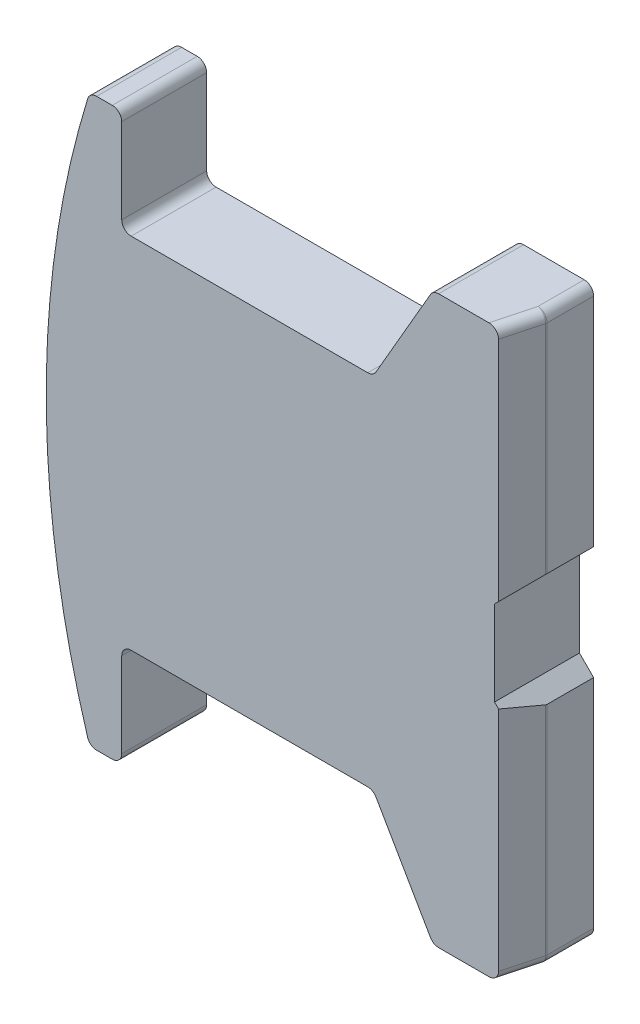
ISO-10303-21;
HEADER;
FILE_DESCRIPTION(('STEP AP214'),'2;1');
FILE_NAME('part.step','',(''),(''),'','','');
FILE_SCHEMA(('AUTOMOTIVE_DESIGN { 1 0 10303 214 1 1 1 1 }'));
ENDSEC;
DATA;
#1=APPLICATION_CONTEXT('core data for automotive mechanical design processes');
#2=APPLICATION_PROTOCOL_DEFINITION('international standard','automotive_design',2000,#1);
#3=PRODUCT_CONTEXT('',#1,'mechanical');
#4=PRODUCT('Part','Part','',(#3));
#5=PRODUCT_RELATED_PRODUCT_CATEGORY('part','',(#4));
#6=PRODUCT_DEFINITION_FORMATION('','',#4);
#7=PRODUCT_DEFINITION_CONTEXT('part definition',#1,'design');
#8=PRODUCT_DEFINITION('design','',#6,#7);
#9=PRODUCT_DEFINITION_SHAPE('','',#8);
#10=(LENGTH_UNIT() NAMED_UNIT(*) SI_UNIT(.MILLI.,.METRE.));
#11=(NAMED_UNIT(*) PLANE_ANGLE_UNIT() SI_UNIT($,.RADIAN.));
#12=(NAMED_UNIT(*) SI_UNIT($,.STERADIAN.) SOLID_ANGLE_UNIT());
#13=UNCERTAINTY_MEASURE_WITH_UNIT(LENGTH_MEASURE(1.E-05),#10,'distance_accuracy_value','');
#14=(GEOMETRIC_REPRESENTATION_CONTEXT(3) GLOBAL_UNCERTAINTY_ASSIGNED_CONTEXT((#13)) GLOBAL_UNIT_ASSIGNED_CONTEXT((#10,
#11,#12)) REPRESENTATION_CONTEXT('',''));
#15=CARTESIAN_POINT('',(0.,0.,0.));
#16=DIRECTION('',(0.,0.,1.));
#17=DIRECTION('',(1.,0.,0.));
#18=AXIS2_PLACEMENT_3D('',#15,#16,#17);
#19=CARTESIAN_POINT('',(-40.,-20.,9.));
#20=DIRECTION('',(0.,0.,-1.));
#21=DIRECTION('',(0.,-1.,0.));
#22=AXIS2_PLACEMENT_3D('',#19,#20,#21);
#23=CYLINDRICAL_SURFACE('',#22,1.);
#24=CARTESIAN_POINT('',(-40.,-20.,0.));
#25=DIRECTION('',(0.,0.,-1.));
#26=DIRECTION('',(0.,1.,0.));
#27=AXIS2_PLACEMENT_3D('',#24,#25,#26);
#28=CIRCLE('',#27,1.);
#29=CARTESIAN_POINT('',(-41.,-20.,0.));
#30=VERTEX_POINT('',#29);
#31=CARTESIAN_POINT('',(-40.,-19.,0.));
#32=VERTEX_POINT('',#31);
#33=EDGE_CURVE('E290',#30,#32,#28,.T.);
#34=ORIENTED_EDGE('',*,*,#33,.T.);
#35=DIRECTION('',(0.,0.,-1.));
#36=VECTOR('',#35,1.);
#37=CARTESIAN_POINT('',(-40.,-19.,9.));
#38=LINE('',#37,#36);
#39=CARTESIAN_POINT('',(-40.,-19.,9.));
#40=VERTEX_POINT('',#39);
#41=EDGE_CURVE('E395',#40,#32,#38,.T.);
#42=ORIENTED_EDGE('',*,*,#41,.F.);
#43=CARTESIAN_POINT('',(-40.,-20.,9.));
#44=DIRECTION('',(0.,0.,-1.));
#45=DIRECTION('',(0.,1.,0.));
#46=AXIS2_PLACEMENT_3D('',#43,#44,#45);
#47=CIRCLE('',#46,1.);
#48=CARTESIAN_POINT('',(-41.,-20.,9.));
#49=VERTEX_POINT('',#48);
#50=EDGE_CURVE('E340',#49,#40,#47,.T.);
#51=ORIENTED_EDGE('',*,*,#50,.F.);
#52=DIRECTION('',(0.,0.,-1.));
#53=VECTOR('',#52,1.);
#54=CARTESIAN_POINT('',(-41.,-20.,9.));
#55=LINE('',#54,#53);
#56=EDGE_CURVE('E289',#49,#30,#55,.T.);
#57=ORIENTED_EDGE('',*,*,#56,.T.);
#58=EDGE_LOOP('',(#34,#42,#51,#57));
#59=FACE_BOUND('',#58,.T.);
#60=ADVANCED_FACE('F14',(#59),#23,.F.);
#61=CARTESIAN_POINT('',(-14.9282032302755,-19.,9.));
#62=DIRECTION('',(0.,1.,0.));
#63=DIRECTION('',(-1.,0.,0.));
#64=AXIS2_PLACEMENT_3D('',#61,#62,#63);
#65=PLANE('',#64);
#66=DIRECTION('',(1.,0.,0.));
#67=VECTOR('',#66,1.);
#68=CARTESIAN_POINT('',(-14.9282032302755,-19.,0.));
#69=LINE('',#68,#67);
#70=CARTESIAN_POINT('',(-14.9282032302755,-19.,0.));
#71=VERTEX_POINT('',#70);
#72=EDGE_CURVE('E293',#32,#71,#69,.T.);
#73=ORIENTED_EDGE('',*,*,#72,.T.);
#74=DIRECTION('',(0.,0.,-1.));
#75=VECTOR('',#74,1.);
#76=CARTESIAN_POINT('',(-14.9282032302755,-19.,9.));
#77=LINE('',#76,#75);
#78=CARTESIAN_POINT('',(-14.9282032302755,-19.,9.));
#79=VERTEX_POINT('',#78);
#80=EDGE_CURVE('E392',#79,#71,#77,.T.);
#81=ORIENTED_EDGE('',*,*,#80,.F.);
#82=DIRECTION('',(1.,0.,0.));
#83=VECTOR('',#82,1.);
#84=CARTESIAN_POINT('',(-14.9282032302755,-19.,9.));
#85=LINE('',#84,#83);
#86=EDGE_CURVE('E519',#40,#79,#85,.T.);
#87=ORIENTED_EDGE('',*,*,#86,.F.);
#88=ORIENTED_EDGE('',*,*,#41,.T.);
#89=EDGE_LOOP('',(#73,#81,#87,#88));
#90=FACE_BOUND('',#89,.T.);
#91=ADVANCED_FACE('F609',(#90),#65,.F.);
#92=CARTESIAN_POINT('',(-14.9282032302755,-20.,9.));
#93=DIRECTION('',(0.,0.,-1.));
#94=DIRECTION('',(0.,-1.,0.));
#95=AXIS2_PLACEMENT_3D('',#92,#93,#94);
#96=CYLINDRICAL_SURFACE('',#95,1.);
#97=CARTESIAN_POINT('',(-14.9282032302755,-20.,0.));
#98=DIRECTION('',(0.,0.,-1.));
#99=DIRECTION('',(0.,1.,0.));
#100=AXIS2_PLACEMENT_3D('',#97,#98,#99);
#101=CIRCLE('',#100,1.);
#102=CARTESIAN_POINT('',(-14.062177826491,-19.5,0.));
#103=VERTEX_POINT('',#102);
#104=EDGE_CURVE('E295',#71,#103,#101,.T.);
#105=ORIENTED_EDGE('',*,*,#104,.T.);
#106=DIRECTION('',(0.,0.,-1.));
#107=VECTOR('',#106,1.);
#108=CARTESIAN_POINT('',(-14.062177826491,-19.5,9.));
#109=LINE('',#108,#107);
#110=CARTESIAN_POINT('',(-14.062177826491,-19.5,9.));
#111=VERTEX_POINT('',#110);
#112=EDGE_CURVE('E389',#111,#103,#109,.T.);
#113=ORIENTED_EDGE('',*,*,#112,.F.);
#114=CARTESIAN_POINT('',(-14.9282032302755,-20.,9.));
#115=DIRECTION('',(0.,0.,-1.));
#116=DIRECTION('',(0.,1.,0.));
#117=AXIS2_PLACEMENT_3D('',#114,#115,#116);
#118=CIRCLE('',#117,1.);
#119=EDGE_CURVE('E521',#79,#111,#118,.T.);
#120=ORIENTED_EDGE('',*,*,#119,.F.);
#121=ORIENTED_EDGE('',*,*,#80,.T.);
#122=EDGE_LOOP('',(#105,#113,#120,#121));
#123=FACE_BOUND('',#122,.T.);
#124=ADVANCED_FACE('F616',(#123),#96,.F.);
#125=CARTESIAN_POINT('',(-8.2886751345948,-29.5,9.));
#126=DIRECTION('',(0.866025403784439,0.5,0.));
#127=DIRECTION('',(-0.5,0.86602540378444,0.));
#128=AXIS2_PLACEMENT_3D('',#125,#126,#127);
#129=PLANE('',#128);
#130=DIRECTION('',(0.5,-0.86602540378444,0.));
#131=VECTOR('',#130,1.);
#132=CARTESIAN_POINT('',(-8.2886751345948,-29.5,0.));
#133=LINE('',#132,#131);
#134=CARTESIAN_POINT('',(-8.2886751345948,-29.5,0.));
#135=VERTEX_POINT('',#134);
#136=EDGE_CURVE('E297',#103,#135,#133,.T.);
#137=ORIENTED_EDGE('',*,*,#136,.T.);
#138=DIRECTION('',(0.,0.,-1.));
#139=VECTOR('',#138,1.);
#140=CARTESIAN_POINT('',(-8.2886751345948,-29.5,9.));
#141=LINE('',#140,#139);
#142=CARTESIAN_POINT('',(-8.2886751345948,-29.5,9.));
#143=VERTEX_POINT('',#142);
#144=EDGE_CURVE('E386',#143,#135,#141,.T.);
#145=ORIENTED_EDGE('',*,*,#144,.F.);
#146=DIRECTION('',(0.5,-0.86602540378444,0.));
#147=VECTOR('',#146,1.);
#148=CARTESIAN_POINT('',(-8.2886751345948,-29.5,9.));
#149=LINE('',#148,#147);
#150=EDGE_CURVE('E523',#111,#143,#149,.T.);
#151=ORIENTED_EDGE('',*,*,#150,.F.);
#152=ORIENTED_EDGE('',*,*,#112,.T.);
#153=EDGE_LOOP('',(#137,#145,#151,#152));
#154=FACE_BOUND('',#153,.T.);
#155=ADVANCED_FACE('F861',(#154),#129,.F.);
#156=CARTESIAN_POINT('',(-7.42264973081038,-29.,9.));
#157=DIRECTION('',(0.,0.,-1.));
#158=DIRECTION('',(0.,-1.,0.));
#159=AXIS2_PLACEMENT_3D('',#156,#157,#158);
#160=CYLINDRICAL_SURFACE('',#159,1.);
#161=CARTESIAN_POINT('',(-7.42264973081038,-29.,0.));
#162=DIRECTION('',(0.,0.,1.));
#163=DIRECTION('',(0.,-1.,0.));
#164=AXIS2_PLACEMENT_3D('',#161,#162,#163);
#165=CIRCLE('',#164,1.);
#166=CARTESIAN_POINT('',(-7.42264973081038,-30.,0.));
#167=VERTEX_POINT('',#166);
#168=EDGE_CURVE('E299',#135,#167,#165,.T.);
#169=ORIENTED_EDGE('',*,*,#168,.T.);
#170=DIRECTION('',(0.,0.,-1.));
#171=VECTOR('',#170,1.);
#172=CARTESIAN_POINT('',(-7.42264973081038,-30.,9.));
#173=LINE('',#172,#171);
#174=CARTESIAN_POINT('',(-7.42264973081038,-30.,9.));
#175=VERTEX_POINT('',#174);
#176=EDGE_CURVE('E383',#175,#167,#173,.T.);
#177=ORIENTED_EDGE('',*,*,#176,.F.);
#178=CARTESIAN_POINT('',(-7.42264973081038,-29.,9.));
#179=DIRECTION('',(0.,0.,1.));
#180=DIRECTION('',(0.,-1.,0.));
#181=AXIS2_PLACEMENT_3D('',#178,#179,#180);
#182=CIRCLE('',#181,1.);
#183=EDGE_CURVE('E525',#143,#175,#182,.T.);
#184=ORIENTED_EDGE('',*,*,#183,.F.);
#185=ORIENTED_EDGE('',*,*,#144,.T.);
#186=EDGE_LOOP('',(#169,#177,#184,#185));
#187=FACE_BOUND('',#186,.T.);
#188=ADVANCED_FACE('F851',(#187),#160,.T.);
#189=CARTESIAN_POINT('',(0.,-30.,9.));
#190=DIRECTION('',(0.,1.,0.));
#191=DIRECTION('',(-1.,0.,0.));
#192=AXIS2_PLACEMENT_3D('',#189,#190,#191);
#193=PLANE('',#192);
#194=DIRECTION('',(0.,0.,-1.));
#195=VECTOR('',#194,1.);
#196=CARTESIAN_POINT('',(-1.,-30.,9.));
#197=LINE('',#196,#195);
#198=CARTESIAN_POINT('',(-1.,-30.,0.));
#199=VERTEX_POINT('',#198);
#200=CARTESIAN_POINT('',(-1.,-30.,4.86834750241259));
#201=VERTEX_POINT('',#200);
#202=EDGE_CURVE('E410',#199,#201,#197,.F.);
#203=ORIENTED_EDGE('',*,*,#202,.T.);
#204=DIRECTION('',(-0.258819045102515,0.,0.96592582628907));
#205=VECTOR('',#204,1.);
#206=CARTESIAN_POINT('',(-1.96592582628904,-30.,8.47323176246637));
#207=LINE('',#206,#205);
#208=CARTESIAN_POINT('',(-2.10707295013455,-30.,9.));
#209=VERTEX_POINT('',#208);
#210=EDGE_CURVE('E412',#201,#209,#207,.T.);
#211=ORIENTED_EDGE('',*,*,#210,.T.);
#212=DIRECTION('',(1.,0.,0.));
#213=VECTOR('',#212,1.);
#214=CARTESIAN_POINT('',(0.,-30.,9.));
#215=LINE('',#214,#213);
#216=EDGE_CURVE('E527',#175,#209,#215,.T.);
#217=ORIENTED_EDGE('',*,*,#216,.F.);
#218=ORIENTED_EDGE('',*,*,#176,.T.);
#219=DIRECTION('',(1.,0.,0.));
#220=VECTOR('',#219,1.);
#221=CARTESIAN_POINT('',(0.,-30.,0.));
#222=LINE('',#221,#220);
#223=EDGE_CURVE('E301',#167,#199,#222,.T.);
#224=ORIENTED_EDGE('',*,*,#223,.T.);
#225=EDGE_LOOP('',(#203,#211,#217,#218,#224));
#226=FACE_BOUND('',#225,.T.);
#227=ADVANCED_FACE('F841',(#226),#193,.F.);
#228=CARTESIAN_POINT('',(0.,-6.,9.));
#229=DIRECTION('',(-1.,0.,0.));
#230=DIRECTION('',(0.,-1.,0.));
#231=AXIS2_PLACEMENT_3D('',#228,#229,#230);
#232=PLANE('',#231);
#233=DIRECTION('',(0.,1.,0.));
#234=VECTOR('',#233,1.);
#235=CARTESIAN_POINT('',(0.,-6.,4.9341737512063));
#236=LINE('',#235,#234);
#237=CARTESIAN_POINT('',(0.,-6.,4.9341737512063));
#238=VERTEX_POINT('',#237);
#239=CARTESIAN_POINT('',(0.,-29.,4.93417375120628));
#240=VERTEX_POINT('',#239);
#241=EDGE_CURVE('E402',#238,#240,#236,.F.);
#242=ORIENTED_EDGE('',*,*,#241,.T.);
#243=DIRECTION('',(0.,0.,-1.));
#244=VECTOR('',#243,1.);
#245=CARTESIAN_POINT('',(0.,-29.,9.));
#246=LINE('',#245,#244);
#247=CARTESIAN_POINT('',(0.,-29.,0.));
#248=VERTEX_POINT('',#247);
#249=EDGE_CURVE('E431',#240,#248,#246,.T.);
#250=ORIENTED_EDGE('',*,*,#249,.T.);
#251=DIRECTION('',(0.,1.,0.));
#252=VECTOR('',#251,1.);
#253=CARTESIAN_POINT('',(0.,-6.,0.));
#254=LINE('',#253,#252);
#255=CARTESIAN_POINT('',(0.,-6.,0.));
#256=VERTEX_POINT('',#255);
#257=EDGE_CURVE('E304',#248,#256,#254,.T.);
#258=ORIENTED_EDGE('',*,*,#257,.T.);
#259=DIRECTION('',(0.,0.,-1.));
#260=VECTOR('',#259,1.);
#261=CARTESIAN_POINT('',(0.,-6.,9.));
#262=LINE('',#261,#260);
#263=EDGE_CURVE('E380',#238,#256,#262,.T.);
#264=ORIENTED_EDGE('',*,*,#263,.F.);
#265=EDGE_LOOP('',(#242,#250,#258,#264));
#266=FACE_BOUND('',#265,.T.);
#267=ADVANCED_FACE('F832',(#266),#232,.F.);
#268=CARTESIAN_POINT('',(0.,-6.,9.));
#269=DIRECTION('',(-0.707106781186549,-0.707106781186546,0.));
#270=DIRECTION('',(0.707106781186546,-0.707106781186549,0.));
#271=AXIS2_PLACEMENT_3D('',#268,#269,#270);
#272=PLANE('',#271);
#273=DIRECTION('',(0.250562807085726,-0.250562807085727,-0.935113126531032));
#274=VECTOR('',#273,1.);
#275=CARTESIAN_POINT('',(-0.937218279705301,-5.0627817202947,8.49774623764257));
#276=LINE('',#275,#274);
#277=CARTESIAN_POINT('',(-1.07179676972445,-4.92820323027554,9.));
#278=VERTEX_POINT('',#277);
#279=CARTESIAN_POINT('',(-0.0170370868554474,-5.98296291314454,5.06358327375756));
#280=VERTEX_POINT('',#279);
#281=EDGE_CURVE('E253',#278,#280,#276,.T.);
#282=ORIENTED_EDGE('',*,*,#281,.T.);
#283=CARTESIAN_POINT('',(-0.5,-5.5,4.9341737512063));
#284=DIRECTION('',(-0.707106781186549,-0.707106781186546,0.));
#285=DIRECTION('',(-0.707106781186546,0.707106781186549,0.));
#286=AXIS2_PLACEMENT_3D('',#283,#284,#285);
#287=ELLIPSE('',#286,0.707106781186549,0.5);
#288=EDGE_CURVE('E400',#280,#238,#287,.F.);
#289=ORIENTED_EDGE('',*,*,#288,.T.);
#290=ORIENTED_EDGE('',*,*,#263,.T.);
#291=DIRECTION('',(-0.707106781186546,0.707106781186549,0.));
#292=VECTOR('',#291,1.);
#293=CARTESIAN_POINT('',(0.,-6.,0.));
#294=LINE('',#293,#292);
#295=CARTESIAN_POINT('',(-1.5,-4.5,0.));
#296=VERTEX_POINT('',#295);
#297=EDGE_CURVE('E306',#256,#296,#294,.T.);
#298=ORIENTED_EDGE('',*,*,#297,.T.);
#299=DIRECTION('',(0.,0.,-1.));
#300=VECTOR('',#299,1.);
#301=CARTESIAN_POINT('',(-1.5,-4.5,9.));
#302=LINE('',#301,#300);
#303=CARTESIAN_POINT('',(-1.5,-4.5,9.));
#304=VERTEX_POINT('',#303);
#305=EDGE_CURVE('E377',#304,#296,#302,.T.);
#306=ORIENTED_EDGE('',*,*,#305,.F.);
#307=DIRECTION('',(-0.707106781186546,0.707106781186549,0.));
#308=VECTOR('',#307,1.);
#309=CARTESIAN_POINT('',(0.,-6.,9.));
#310=LINE('',#309,#308);
#311=EDGE_CURVE('E264',#278,#304,#310,.T.);
#312=ORIENTED_EDGE('',*,*,#311,.F.);
#313=EDGE_LOOP('',(#282,#289,#290,#298,#306,#312));
#314=FACE_BOUND('',#313,.T.);
#315=ADVANCED_FACE('F533',(#314),#272,.F.);
#316=CARTESIAN_POINT('',(-1.5,-4.5,9.));
#317=DIRECTION('',(-1.,0.,0.));
#318=DIRECTION('',(0.,-1.,0.));
#319=AXIS2_PLACEMENT_3D('',#316,#317,#318);
#320=PLANE('',#319);
#321=DIRECTION('',(0.,1.,0.));
#322=VECTOR('',#321,1.);
#323=CARTESIAN_POINT('',(-1.5,-4.5,0.));
#324=LINE('',#323,#322);
#325=CARTESIAN_POINT('',(-1.5,4.5,0.));
#326=VERTEX_POINT('',#325);
#327=EDGE_CURVE('E308',#296,#326,#324,.T.);
#328=ORIENTED_EDGE('',*,*,#327,.T.);
#329=DIRECTION('',(0.,0.,-1.));
#330=VECTOR('',#329,1.);
#331=CARTESIAN_POINT('',(-1.5,4.5,9.));
#332=LINE('',#331,#330);
#333=CARTESIAN_POINT('',(-1.5,4.5,9.));
#334=VERTEX_POINT('',#333);
#335=EDGE_CURVE('E375',#334,#326,#332,.T.);
#336=ORIENTED_EDGE('',*,*,#335,.F.);
#337=DIRECTION('',(0.,1.,0.));
#338=VECTOR('',#337,1.);
#339=CARTESIAN_POINT('',(-1.5,-4.5,9.));
#340=LINE('',#339,#338);
#341=EDGE_CURVE('E258',#304,#334,#340,.T.);
#342=ORIENTED_EDGE('',*,*,#341,.F.);
#343=ORIENTED_EDGE('',*,*,#305,.T.);
#344=EDGE_LOOP('',(#328,#336,#342,#343));
#345=FACE_BOUND('',#344,.T.);
#346=ADVANCED_FACE('F537',(#345),#320,.F.);
#347=CARTESIAN_POINT('',(0.,6.,9.));
#348=DIRECTION('',(-0.707106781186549,0.707106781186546,0.));
#349=DIRECTION('',(-0.707106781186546,-0.707106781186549,0.));
#350=AXIS2_PLACEMENT_3D('',#347,#348,#349);
#351=PLANE('',#350);
#352=DIRECTION('',(0.,0.,-1.));
#353=VECTOR('',#352,1.);
#354=CARTESIAN_POINT('',(0.,6.,9.));
#355=LINE('',#354,#353);
#356=CARTESIAN_POINT('',(0.,6.,4.9341737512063));
#357=VERTEX_POINT('',#356);
#358=CARTESIAN_POINT('',(0.,6.,0.));
#359=VERTEX_POINT('',#358);
#360=EDGE_CURVE('E373',#357,#359,#355,.T.);
#361=ORIENTED_EDGE('',*,*,#360,.F.);
#362=CARTESIAN_POINT('',(-0.5,5.5,4.9341737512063));
#363=DIRECTION('',(-0.707106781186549,0.707106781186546,0.));
#364=DIRECTION('',(0.707106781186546,0.707106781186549,0.));
#365=AXIS2_PLACEMENT_3D('',#362,#363,#364);
#366=ELLIPSE('',#365,0.707106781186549,0.5);
#367=CARTESIAN_POINT('',(-0.0170370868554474,5.98296291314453,5.06358327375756));
#368=VERTEX_POINT('',#367);
#369=EDGE_CURVE('E252',#357,#368,#366,.F.);
#370=ORIENTED_EDGE('',*,*,#369,.T.);
#371=DIRECTION('',(-0.250562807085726,-0.250562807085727,0.935113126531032));
#372=VECTOR('',#371,1.);
#373=CARTESIAN_POINT('',(-0.937218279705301,5.06278172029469,8.49774623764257));
#374=LINE('',#373,#372);
#375=CARTESIAN_POINT('',(-1.07179676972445,4.92820323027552,9.));
#376=VERTEX_POINT('',#375);
#377=EDGE_CURVE('E235',#368,#376,#374,.T.);
#378=ORIENTED_EDGE('',*,*,#377,.T.);
#379=DIRECTION('',(0.707106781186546,0.707106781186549,0.));
#380=VECTOR('',#379,1.);
#381=CARTESIAN_POINT('',(0.,6.,9.));
#382=LINE('',#381,#380);
#383=EDGE_CURVE('E250',#334,#376,#382,.T.);
#384=ORIENTED_EDGE('',*,*,#383,.F.);
#385=ORIENTED_EDGE('',*,*,#335,.T.);
#386=DIRECTION('',(0.707106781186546,0.707106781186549,0.));
#387=VECTOR('',#386,1.);
#388=CARTESIAN_POINT('',(0.,6.,0.));
#389=LINE('',#388,#387);
#390=EDGE_CURVE('E310',#326,#359,#389,.T.);
#391=ORIENTED_EDGE('',*,*,#390,.T.);
#392=EDGE_LOOP('',(#361,#370,#378,#384,#385,#391));
#393=FACE_BOUND('',#392,.T.);
#394=ADVANCED_FACE('F248',(#393),#351,.F.);
#395=CARTESIAN_POINT('',(0.,30.,9.));
#396=DIRECTION('',(-1.,0.,0.));
#397=DIRECTION('',(0.,-1.,0.));
#398=AXIS2_PLACEMENT_3D('',#395,#396,#397);
#399=PLANE('',#398);
#400=DIRECTION('',(0.,1.,0.));
#401=VECTOR('',#400,1.);
#402=CARTESIAN_POINT('',(0.,30.,0.));
#403=LINE('',#402,#401);
#404=CARTESIAN_POINT('',(0.,29.,0.));
#405=VERTEX_POINT('',#404);
#406=EDGE_CURVE('E313',#359,#405,#403,.T.);
#407=ORIENTED_EDGE('',*,*,#406,.T.);
#408=DIRECTION('',(0.,0.,-1.));
#409=VECTOR('',#408,1.);
#410=CARTESIAN_POINT('',(0.,29.,9.));
#411=LINE('',#410,#409);
#412=CARTESIAN_POINT('',(0.,29.,4.9341737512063));
#413=VERTEX_POINT('',#412);
#414=EDGE_CURVE('E437',#405,#413,#411,.F.);
#415=ORIENTED_EDGE('',*,*,#414,.T.);
#416=DIRECTION('',(0.,1.,0.));
#417=VECTOR('',#416,1.);
#418=CARTESIAN_POINT('',(0.,30.,4.9341737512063));
#419=LINE('',#418,#417);
#420=EDGE_CURVE('E407',#413,#357,#419,.F.);
#421=ORIENTED_EDGE('',*,*,#420,.T.);
#422=ORIENTED_EDGE('',*,*,#360,.T.);
#423=EDGE_LOOP('',(#407,#415,#421,#422));
#424=FACE_BOUND('',#423,.T.);
#425=ADVANCED_FACE('F544',(#424),#399,.F.);
#426=CARTESIAN_POINT('',(-7.42264973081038,30.,9.));
#427=DIRECTION('',(0.,-1.,0.));
#428=DIRECTION('',(1.,0.,0.));
#429=AXIS2_PLACEMENT_3D('',#426,#427,#428);
#430=PLANE('',#429);
#431=DIRECTION('',(-1.,0.,0.));
#432=VECTOR('',#431,1.);
#433=CARTESIAN_POINT('',(-7.42264973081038,30.,9.));
#434=LINE('',#433,#432);
#435=CARTESIAN_POINT('',(-2.10707295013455,30.,9.));
#436=VERTEX_POINT('',#435);
#437=CARTESIAN_POINT('',(-7.42264973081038,30.,9.));
#438=VERTEX_POINT('',#437);
#439=EDGE_CURVE('E260',#436,#438,#434,.T.);
#440=ORIENTED_EDGE('',*,*,#439,.F.);
#441=DIRECTION('',(0.258819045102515,0.,-0.96592582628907));
#442=VECTOR('',#441,1.);
#443=CARTESIAN_POINT('',(-2.46314907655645,30.,10.3288941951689));
#444=LINE('',#443,#442);
#445=CARTESIAN_POINT('',(-1.,30.,4.8683475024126));
#446=VERTEX_POINT('',#445);
#447=EDGE_CURVE('E425',#436,#446,#444,.T.);
#448=ORIENTED_EDGE('',*,*,#447,.T.);
#449=DIRECTION('',(0.,0.,-1.));
#450=VECTOR('',#449,1.);
#451=CARTESIAN_POINT('',(-1.,30.,9.));
#452=LINE('',#451,#450);
#453=CARTESIAN_POINT('',(-1.,30.,0.));
#454=VERTEX_POINT('',#453);
#455=EDGE_CURVE('E423',#446,#454,#452,.T.);
#456=ORIENTED_EDGE('',*,*,#455,.T.);
#457=DIRECTION('',(-1.,0.,0.));
#458=VECTOR('',#457,1.);
#459=CARTESIAN_POINT('',(-7.42264973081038,30.,0.));
#460=LINE('',#459,#458);
#461=CARTESIAN_POINT('',(-7.42264973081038,30.,0.));
#462=VERTEX_POINT('',#461);
#463=EDGE_CURVE('E316',#454,#462,#460,.T.);
#464=ORIENTED_EDGE('',*,*,#463,.T.);
#465=DIRECTION('',(0.,0.,-1.));
#466=VECTOR('',#465,1.);
#467=CARTESIAN_POINT('',(-7.42264973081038,30.,9.));
#468=LINE('',#467,#466);
#469=EDGE_CURVE('E370',#438,#462,#468,.T.);
#470=ORIENTED_EDGE('',*,*,#469,.F.);
#471=EDGE_LOOP('',(#440,#448,#456,#464,#470));
#472=FACE_BOUND('',#471,.T.);
#473=ADVANCED_FACE('F557',(#472),#430,.F.);
#474=CARTESIAN_POINT('',(-7.42264973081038,29.,9.));
#475=DIRECTION('',(0.,0.,-1.));
#476=DIRECTION('',(0.,-1.,0.));
#477=AXIS2_PLACEMENT_3D('',#474,#475,#476);
#478=CYLINDRICAL_SURFACE('',#477,1.);
#479=CARTESIAN_POINT('',(-7.42264973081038,29.,0.));
#480=DIRECTION('',(0.,0.,1.));
#481=DIRECTION('',(0.,1.,0.));
#482=AXIS2_PLACEMENT_3D('',#479,#480,#481);
#483=CIRCLE('',#482,1.);
#484=CARTESIAN_POINT('',(-8.2886751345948,29.5,0.));
#485=VERTEX_POINT('',#484);
#486=EDGE_CURVE('E318',#462,#485,#483,.T.);
#487=ORIENTED_EDGE('',*,*,#486,.T.);
#488=DIRECTION('',(0.,0.,-1.));
#489=VECTOR('',#488,1.);
#490=CARTESIAN_POINT('',(-8.2886751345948,29.5,9.));
#491=LINE('',#490,#489);
#492=CARTESIAN_POINT('',(-8.2886751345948,29.5,9.));
#493=VERTEX_POINT('',#492);
#494=EDGE_CURVE('E367',#493,#485,#491,.T.);
#495=ORIENTED_EDGE('',*,*,#494,.F.);
#496=CARTESIAN_POINT('',(-7.42264973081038,29.,9.));
#497=DIRECTION('',(0.,0.,1.));
#498=DIRECTION('',(0.,1.,0.));
#499=AXIS2_PLACEMENT_3D('',#496,#497,#498);
#500=CIRCLE('',#499,1.);
#501=EDGE_CURVE('E262',#438,#493,#500,.T.);
#502=ORIENTED_EDGE('',*,*,#501,.F.);
#503=ORIENTED_EDGE('',*,*,#469,.T.);
#504=EDGE_LOOP('',(#487,#495,#502,#503));
#505=FACE_BOUND('',#504,.T.);
#506=ADVANCED_FACE('F562',(#505),#478,.T.);
#507=CARTESIAN_POINT('',(-14.062177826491,19.5,9.));
#508=DIRECTION('',(0.86602540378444,-0.5,0.));
#509=DIRECTION('',(0.5,0.86602540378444,0.));
#510=AXIS2_PLACEMENT_3D('',#507,#508,#509);
#511=PLANE('',#510);
#512=DIRECTION('',(-0.5,-0.86602540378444,0.));
#513=VECTOR('',#512,1.);
#514=CARTESIAN_POINT('',(-14.062177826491,19.5,0.));
#515=LINE('',#514,#513);
#516=CARTESIAN_POINT('',(-14.062177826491,19.5,0.));
#517=VERTEX_POINT('',#516);
#518=EDGE_CURVE('E320',#485,#517,#515,.T.);
#519=ORIENTED_EDGE('',*,*,#518,.T.);
#520=DIRECTION('',(0.,0.,-1.));
#521=VECTOR('',#520,1.);
#522=CARTESIAN_POINT('',(-14.062177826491,19.5,9.));
#523=LINE('',#522,#521);
#524=CARTESIAN_POINT('',(-14.062177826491,19.5,9.));
#525=VERTEX_POINT('',#524);
#526=EDGE_CURVE('E364',#525,#517,#523,.T.);
#527=ORIENTED_EDGE('',*,*,#526,.F.);
#528=DIRECTION('',(-0.5,-0.86602540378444,0.));
#529=VECTOR('',#528,1.);
#530=CARTESIAN_POINT('',(-14.062177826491,19.5,9.));
#531=LINE('',#530,#529);
#532=EDGE_CURVE('E269',#493,#525,#531,.T.);
#533=ORIENTED_EDGE('',*,*,#532,.F.);
#534=ORIENTED_EDGE('',*,*,#494,.T.);
#535=EDGE_LOOP('',(#519,#527,#533,#534));
#536=FACE_BOUND('',#535,.T.);
#537=ADVANCED_FACE('F568',(#536),#511,.F.);
#538=CARTESIAN_POINT('',(-14.9282032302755,20.,9.));
#539=DIRECTION('',(0.,0.,-1.));
#540=DIRECTION('',(0.,-1.,0.));
#541=AXIS2_PLACEMENT_3D('',#538,#539,#540);
#542=CYLINDRICAL_SURFACE('',#541,1.);
#543=CARTESIAN_POINT('',(-14.9282032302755,20.,0.));
#544=DIRECTION('',(0.,0.,-1.));
#545=DIRECTION('',(0.,-1.,0.));
#546=AXIS2_PLACEMENT_3D('',#543,#544,#545);
#547=CIRCLE('',#546,1.);
#548=CARTESIAN_POINT('',(-14.9282032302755,19.,0.));
#549=VERTEX_POINT('',#548);
#550=EDGE_CURVE('E322',#517,#549,#547,.T.);
#551=ORIENTED_EDGE('',*,*,#550,.T.);
#552=DIRECTION('',(0.,0.,-1.));
#553=VECTOR('',#552,1.);
#554=CARTESIAN_POINT('',(-14.9282032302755,19.,9.));
#555=LINE('',#554,#553);
#556=CARTESIAN_POINT('',(-14.9282032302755,19.,9.));
#557=VERTEX_POINT('',#556);
#558=EDGE_CURVE('E361',#557,#549,#555,.T.);
#559=ORIENTED_EDGE('',*,*,#558,.F.);
#560=CARTESIAN_POINT('',(-14.9282032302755,20.,9.));
#561=DIRECTION('',(0.,0.,-1.));
#562=DIRECTION('',(0.,-1.,0.));
#563=AXIS2_PLACEMENT_3D('',#560,#561,#562);
#564=CIRCLE('',#563,1.);
#565=EDGE_CURVE('E271',#525,#557,#564,.T.);
#566=ORIENTED_EDGE('',*,*,#565,.F.);
#567=ORIENTED_EDGE('',*,*,#526,.T.);
#568=EDGE_LOOP('',(#551,#559,#566,#567));
#569=FACE_BOUND('',#568,.T.);
#570=ADVANCED_FACE('F572',(#569),#542,.F.);
#571=CARTESIAN_POINT('',(-40.,19.,9.));
#572=DIRECTION('',(0.,-1.,0.));
#573=DIRECTION('',(1.,0.,0.));
#574=AXIS2_PLACEMENT_3D('',#571,#572,#573);
#575=PLANE('',#574);
#576=DIRECTION('',(-1.,0.,0.));
#577=VECTOR('',#576,1.);
#578=CARTESIAN_POINT('',(-40.,19.,0.));
#579=LINE('',#578,#577);
#580=CARTESIAN_POINT('',(-40.,19.,0.));
#581=VERTEX_POINT('',#580);
#582=EDGE_CURVE('E324',#549,#581,#579,.T.);
#583=ORIENTED_EDGE('',*,*,#582,.T.);
#584=DIRECTION('',(0.,0.,-1.));
#585=VECTOR('',#584,1.);
#586=CARTESIAN_POINT('',(-40.,19.,9.));
#587=LINE('',#586,#585);
#588=CARTESIAN_POINT('',(-40.,19.,9.));
#589=VERTEX_POINT('',#588);
#590=EDGE_CURVE('E358',#589,#581,#587,.T.);
#591=ORIENTED_EDGE('',*,*,#590,.F.);
#592=DIRECTION('',(-1.,0.,0.));
#593=VECTOR('',#592,1.);
#594=CARTESIAN_POINT('',(-40.,19.,9.));
#595=LINE('',#594,#593);
#596=EDGE_CURVE('E273',#557,#589,#595,.T.);
#597=ORIENTED_EDGE('',*,*,#596,.F.);
#598=ORIENTED_EDGE('',*,*,#558,.T.);
#599=EDGE_LOOP('',(#583,#591,#597,#598));
#600=FACE_BOUND('',#599,.T.);
#601=ADVANCED_FACE('F577',(#600),#575,.F.);
#602=CARTESIAN_POINT('',(-40.,20.,9.));
#603=DIRECTION('',(0.,0.,-1.));
#604=DIRECTION('',(0.,-1.,0.));
#605=AXIS2_PLACEMENT_3D('',#602,#603,#604);
#606=CYLINDRICAL_SURFACE('',#605,1.);
#607=CARTESIAN_POINT('',(-40.,20.,0.));
#608=DIRECTION('',(0.,0.,-1.));
#609=DIRECTION('',(0.,-1.,0.));
#610=AXIS2_PLACEMENT_3D('',#607,#608,#609);
#611=CIRCLE('',#610,1.);
#612=CARTESIAN_POINT('',(-41.,20.,0.));
#613=VERTEX_POINT('',#612);
#614=EDGE_CURVE('E326',#581,#613,#611,.T.);
#615=ORIENTED_EDGE('',*,*,#614,.T.);
#616=DIRECTION('',(0.,0.,-1.));
#617=VECTOR('',#616,1.);
#618=CARTESIAN_POINT('',(-41.,20.,9.));
#619=LINE('',#618,#617);
#620=CARTESIAN_POINT('',(-41.,20.,9.));
#621=VERTEX_POINT('',#620);
#622=EDGE_CURVE('E355',#621,#613,#619,.T.);
#623=ORIENTED_EDGE('',*,*,#622,.F.);
#624=CARTESIAN_POINT('',(-40.,20.,9.));
#625=DIRECTION('',(0.,0.,-1.));
#626=DIRECTION('',(0.,-1.,0.));
#627=AXIS2_PLACEMENT_3D('',#624,#625,#626);
#628=CIRCLE('',#627,1.);
#629=EDGE_CURVE('E275',#589,#621,#628,.T.);
#630=ORIENTED_EDGE('',*,*,#629,.F.);
#631=ORIENTED_EDGE('',*,*,#590,.T.);
#632=EDGE_LOOP('',(#615,#623,#630,#631));
#633=FACE_BOUND('',#632,.T.);
#634=ADVANCED_FACE('F583',(#633),#606,.F.);
#635=CARTESIAN_POINT('',(-41.,29.,9.));
#636=DIRECTION('',(-1.,0.,0.));
#637=DIRECTION('',(0.,-1.,0.));
#638=AXIS2_PLACEMENT_3D('',#635,#636,#637);
#639=PLANE('',#638);
#640=DIRECTION('',(0.,1.,0.));
#641=VECTOR('',#640,1.);
#642=CARTESIAN_POINT('',(-41.,29.,0.));
#643=LINE('',#642,#641);
#644=CARTESIAN_POINT('',(-41.,29.,0.));
#645=VERTEX_POINT('',#644);
#646=EDGE_CURVE('E328',#613,#645,#643,.T.);
#647=ORIENTED_EDGE('',*,*,#646,.T.);
#648=DIRECTION('',(0.,0.,-1.));
#649=VECTOR('',#648,1.);
#650=CARTESIAN_POINT('',(-41.,29.,9.));
#651=LINE('',#650,#649);
#652=CARTESIAN_POINT('',(-41.,29.,9.));
#653=VERTEX_POINT('',#652);
#654=EDGE_CURVE('E352',#653,#645,#651,.T.);
#655=ORIENTED_EDGE('',*,*,#654,.F.);
#656=DIRECTION('',(0.,1.,0.));
#657=VECTOR('',#656,1.);
#658=CARTESIAN_POINT('',(-41.,29.,9.));
#659=LINE('',#658,#657);
#660=EDGE_CURVE('E277',#621,#653,#659,.T.);
#661=ORIENTED_EDGE('',*,*,#660,.F.);
#662=ORIENTED_EDGE('',*,*,#622,.T.);
#663=EDGE_LOOP('',(#647,#655,#661,#662));
#664=FACE_BOUND('',#663,.T.);
#665=ADVANCED_FACE('F587',(#664),#639,.F.);
#666=CARTESIAN_POINT('',(-42.,29.,9.));
#667=DIRECTION('',(0.,0.,-1.));
#668=DIRECTION('',(0.,-1.,0.));
#669=AXIS2_PLACEMENT_3D('',#666,#667,#668);
#670=CYLINDRICAL_SURFACE('',#669,1.);
#671=CARTESIAN_POINT('',(-42.,29.,0.));
#672=DIRECTION('',(0.,0.,1.));
#673=DIRECTION('',(0.,1.,0.));
#674=AXIS2_PLACEMENT_3D('',#671,#672,#673);
#675=CIRCLE('',#674,1.);
#676=CARTESIAN_POINT('',(-42.,30.,0.));
#677=VERTEX_POINT('',#676);
#678=EDGE_CURVE('E330',#645,#677,#675,.T.);
#679=ORIENTED_EDGE('',*,*,#678,.T.);
#680=DIRECTION('',(0.,0.,-1.));
#681=VECTOR('',#680,1.);
#682=CARTESIAN_POINT('',(-42.,30.,9.));
#683=LINE('',#682,#681);
#684=CARTESIAN_POINT('',(-42.,30.,9.));
#685=VERTEX_POINT('',#684);
#686=EDGE_CURVE('E349',#685,#677,#683,.T.);
#687=ORIENTED_EDGE('',*,*,#686,.F.);
#688=CARTESIAN_POINT('',(-42.,29.,9.));
#689=DIRECTION('',(0.,0.,1.));
#690=DIRECTION('',(0.,1.,0.));
#691=AXIS2_PLACEMENT_3D('',#688,#689,#690);
#692=CIRCLE('',#691,1.);
#693=EDGE_CURVE('E279',#653,#685,#692,.T.);
#694=ORIENTED_EDGE('',*,*,#693,.F.);
#695=ORIENTED_EDGE('',*,*,#654,.T.);
#696=EDGE_LOOP('',(#679,#687,#694,#695));
#697=FACE_BOUND('',#696,.T.);
#698=ADVANCED_FACE('F592',(#697),#670,.T.);
#699=CARTESIAN_POINT('',(-42.,30.,9.));
#700=DIRECTION('',(0.,-1.,0.));
#701=DIRECTION('',(1.,0.,0.));
#702=AXIS2_PLACEMENT_3D('',#699,#700,#701);
#703=PLANE('',#702);
#704=DIRECTION('',(-1.,0.,0.));
#705=VECTOR('',#704,1.);
#706=CARTESIAN_POINT('',(-42.,30.,0.));
#707=LINE('',#706,#705);
#708=CARTESIAN_POINT('',(-43.6572765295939,30.,0.));
#709=VERTEX_POINT('',#708);
#710=EDGE_CURVE('E332',#677,#709,#707,.T.);
#711=ORIENTED_EDGE('',*,*,#710,.T.);
#712=DIRECTION('',(0.,0.,-1.));
#713=VECTOR('',#712,1.);
#714=CARTESIAN_POINT('',(-43.6572765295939,30.,9.));
#715=LINE('',#714,#713);
#716=CARTESIAN_POINT('',(-43.6572765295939,30.,9.));
#717=VERTEX_POINT('',#716);
#718=EDGE_CURVE('E9',#709,#717,#715,.F.);
#719=ORIENTED_EDGE('',*,*,#718,.T.);
#720=DIRECTION('',(-1.,0.,0.));
#721=VECTOR('',#720,1.);
#722=CARTESIAN_POINT('',(-42.,30.,9.));
#723=LINE('',#722,#721);
#724=EDGE_CURVE('E281',#685,#717,#723,.T.);
#725=ORIENTED_EDGE('',*,*,#724,.F.);
#726=ORIENTED_EDGE('',*,*,#686,.T.);
#727=EDGE_LOOP('',(#711,#719,#725,#726));
#728=FACE_BOUND('',#727,.T.);
#729=ADVANCED_FACE('F596',(#728),#703,.F.);
#730=CARTESIAN_POINT('',(-42.,-30.,9.));
#731=DIRECTION('',(0.,1.,0.));
#732=DIRECTION('',(-1.,0.,0.));
#733=AXIS2_PLACEMENT_3D('',#730,#731,#732);
#734=PLANE('',#733);
#735=DIRECTION('',(1.,0.,0.));
#736=VECTOR('',#735,1.);
#737=CARTESIAN_POINT('',(-42.,-30.,9.));
#738=LINE('',#737,#736);
#739=CARTESIAN_POINT('',(-43.6572765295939,-30.,9.));
#740=VERTEX_POINT('',#739);
#741=CARTESIAN_POINT('',(-42.,-30.,9.));
#742=VERTEX_POINT('',#741);
#743=EDGE_CURVE('E283',#740,#742,#738,.T.);
#744=ORIENTED_EDGE('',*,*,#743,.F.);
#745=DIRECTION('',(0.,0.,-1.));
#746=VECTOR('',#745,1.);
#747=CARTESIAN_POINT('',(-43.6572765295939,-30.,9.));
#748=LINE('',#747,#746);
#749=CARTESIAN_POINT('',(-43.6572765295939,-30.,0.));
#750=VERTEX_POINT('',#749);
#751=EDGE_CURVE('E439',#740,#750,#748,.T.);
#752=ORIENTED_EDGE('',*,*,#751,.T.);
#753=DIRECTION('',(1.,0.,0.));
#754=VECTOR('',#753,1.);
#755=CARTESIAN_POINT('',(-42.,-30.,0.));
#756=LINE('',#755,#754);
#757=CARTESIAN_POINT('',(-42.,-30.,0.));
#758=VERTEX_POINT('',#757);
#759=EDGE_CURVE('E334',#750,#758,#756,.T.);
#760=ORIENTED_EDGE('',*,*,#759,.T.);
#761=DIRECTION('',(0.,0.,-1.));
#762=VECTOR('',#761,1.);
#763=CARTESIAN_POINT('',(-42.,-30.,9.));
#764=LINE('',#763,#762);
#765=EDGE_CURVE('E346',#742,#758,#764,.T.);
#766=ORIENTED_EDGE('',*,*,#765,.F.);
#767=EDGE_LOOP('',(#744,#752,#760,#766));
#768=FACE_BOUND('',#767,.T.);
#769=ADVANCED_FACE('F502',(#768),#734,.F.);
#770=CARTESIAN_POINT('',(-42.,-29.,9.));
#771=DIRECTION('',(0.,0.,-1.));
#772=DIRECTION('',(0.,-1.,0.));
#773=AXIS2_PLACEMENT_3D('',#770,#771,#772);
#774=CYLINDRICAL_SURFACE('',#773,1.);
#775=CARTESIAN_POINT('',(-42.,-29.,0.));
#776=DIRECTION('',(0.,0.,1.));
#777=DIRECTION('',(0.,1.,0.));
#778=AXIS2_PLACEMENT_3D('',#775,#776,#777);
#779=CIRCLE('',#778,1.);
#780=CARTESIAN_POINT('',(-41.,-29.,0.));
#781=VERTEX_POINT('',#780);
#782=EDGE_CURVE('E336',#758,#781,#779,.T.);
#783=ORIENTED_EDGE('',*,*,#782,.T.);
#784=DIRECTION('',(0.,0.,-1.));
#785=VECTOR('',#784,1.);
#786=CARTESIAN_POINT('',(-41.,-29.,9.));
#787=LINE('',#786,#785);
#788=CARTESIAN_POINT('',(-41.,-29.,9.));
#789=VERTEX_POINT('',#788);
#790=EDGE_CURVE('E343',#789,#781,#787,.T.);
#791=ORIENTED_EDGE('',*,*,#790,.F.);
#792=CARTESIAN_POINT('',(-42.,-29.,9.));
#793=DIRECTION('',(0.,0.,1.));
#794=DIRECTION('',(0.,1.,0.));
#795=AXIS2_PLACEMENT_3D('',#792,#793,#794);
#796=CIRCLE('',#795,1.);
#797=EDGE_CURVE('E285',#742,#789,#796,.T.);
#798=ORIENTED_EDGE('',*,*,#797,.F.);
#799=ORIENTED_EDGE('',*,*,#765,.T.);
#800=EDGE_LOOP('',(#783,#791,#798,#799));
#801=FACE_BOUND('',#800,.T.);
#802=ADVANCED_FACE('F605',(#801),#774,.T.);
#803=CARTESIAN_POINT('',(-41.,-29.,9.));
#804=DIRECTION('',(-1.,0.,0.));
#805=DIRECTION('',(0.,-1.,0.));
#806=AXIS2_PLACEMENT_3D('',#803,#804,#805);
#807=PLANE('',#806);
#808=DIRECTION('',(0.,1.,0.));
#809=VECTOR('',#808,1.);
#810=CARTESIAN_POINT('',(-41.,-29.,0.));
#811=LINE('',#810,#809);
#812=EDGE_CURVE('E338',#781,#30,#811,.T.);
#813=ORIENTED_EDGE('',*,*,#812,.T.);
#814=ORIENTED_EDGE('',*,*,#56,.F.);
#815=DIRECTION('',(0.,1.,0.));
#816=VECTOR('',#815,1.);
#817=CARTESIAN_POINT('',(-41.,-29.,9.));
#818=LINE('',#817,#816);
#819=EDGE_CURVE('E287',#789,#49,#818,.T.);
#820=ORIENTED_EDGE('',*,*,#819,.F.);
#821=ORIENTED_EDGE('',*,*,#790,.T.);
#822=EDGE_LOOP('',(#813,#814,#820,#821));
#823=FACE_BOUND('',#822,.T.);
#824=ADVANCED_FACE('F723',(#823),#807,.F.);
#825=CARTESIAN_POINT('',(-40.,-20.,9.));
#826=DIRECTION('',(0.,0.,1.));
#827=DIRECTION('',(0.,1.,0.));
#828=AXIS2_PLACEMENT_3D('',#825,#826,#827);
#829=PLANE('',#828);
#830=CARTESIAN_POINT('',(51.,0.,9.));
#831=DIRECTION('',(0.,0.,1.));
#832=DIRECTION('',(0.,1.,0.));
#833=AXIS2_PLACEMENT_3D('',#830,#831,#832);
#834=CIRCLE('',#833,100.);
#835=CARTESIAN_POINT('',(-44.6134106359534,29.2929292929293,9.));
#836=VERTEX_POINT('',#835);
#837=CARTESIAN_POINT('',(-44.6134106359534,-29.2929292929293,9.));
#838=VERTEX_POINT('',#837);
#839=EDGE_CURVE('E498',#836,#838,#834,.T.);
#840=ORIENTED_EDGE('',*,*,#839,.T.);
#841=CARTESIAN_POINT('',(-43.6572765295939,-29.,9.));
#842=DIRECTION('',(0.,0.,1.));
#843=DIRECTION('',(0.,1.,0.));
#844=AXIS2_PLACEMENT_3D('',#841,#842,#843);
#845=CIRCLE('',#844,1.);
#846=EDGE_CURVE('E22',#838,#740,#845,.T.);
#847=ORIENTED_EDGE('',*,*,#846,.T.);
#848=ORIENTED_EDGE('',*,*,#743,.T.);
#849=ORIENTED_EDGE('',*,*,#797,.T.);
#850=ORIENTED_EDGE('',*,*,#819,.T.);
#851=ORIENTED_EDGE('',*,*,#50,.T.);
#852=ORIENTED_EDGE('',*,*,#86,.T.);
#853=ORIENTED_EDGE('',*,*,#119,.T.);
#854=ORIENTED_EDGE('',*,*,#150,.T.);
#855=ORIENTED_EDGE('',*,*,#183,.T.);
#856=ORIENTED_EDGE('',*,*,#216,.T.);
#857=CARTESIAN_POINT('',(-2.10707295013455,-29.,9.));
#858=DIRECTION('',(0.,0.,1.));
#859=DIRECTION('',(-1.,0.,0.));
#860=AXIS2_PLACEMENT_3D('',#857,#858,#859);
#861=ELLIPSE('',#860,1.03527618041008,1.);
#862=CARTESIAN_POINT('',(-1.07179676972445,-29.,9.));
#863=VERTEX_POINT('',#862);
#864=EDGE_CURVE('E417',#209,#863,#861,.T.);
#865=ORIENTED_EDGE('',*,*,#864,.T.);
#866=DIRECTION('',(0.,-1.,0.));
#867=VECTOR('',#866,1.);
#868=CARTESIAN_POINT('',(-1.07179676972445,-20.,9.));
#869=LINE('',#868,#867);
#870=EDGE_CURVE('E243',#278,#863,#869,.T.);
#871=ORIENTED_EDGE('',*,*,#870,.F.);
#872=ORIENTED_EDGE('',*,*,#311,.T.);
#873=ORIENTED_EDGE('',*,*,#341,.T.);
#874=ORIENTED_EDGE('',*,*,#383,.T.);
#875=CARTESIAN_POINT('',(-1.07179676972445,29.,9.));
#876=VERTEX_POINT('',#875);
#877=EDGE_CURVE('E231',#876,#376,#869,.T.);
#878=ORIENTED_EDGE('',*,*,#877,.F.);
#879=CARTESIAN_POINT('',(-2.10707295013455,29.,9.));
#880=DIRECTION('',(0.,0.,1.));
#881=DIRECTION('',(1.,0.,0.));
#882=AXIS2_PLACEMENT_3D('',#879,#880,#881);
#883=ELLIPSE('',#882,1.03527618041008,1.);
#884=EDGE_CURVE('E415',#876,#436,#883,.T.);
#885=ORIENTED_EDGE('',*,*,#884,.T.);
#886=ORIENTED_EDGE('',*,*,#439,.T.);
#887=ORIENTED_EDGE('',*,*,#501,.T.);
#888=ORIENTED_EDGE('',*,*,#532,.T.);
#889=ORIENTED_EDGE('',*,*,#565,.T.);
#890=ORIENTED_EDGE('',*,*,#596,.T.);
#891=ORIENTED_EDGE('',*,*,#629,.T.);
#892=ORIENTED_EDGE('',*,*,#660,.T.);
#893=ORIENTED_EDGE('',*,*,#693,.T.);
#894=ORIENTED_EDGE('',*,*,#724,.T.);
#895=CARTESIAN_POINT('',(-43.6572765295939,29.,9.));
#896=DIRECTION('',(0.,0.,1.));
#897=DIRECTION('',(0.,1.,0.));
#898=AXIS2_PLACEMENT_3D('',#895,#896,#897);
#899=CIRCLE('',#898,1.);
#900=EDGE_CURVE('E494',#717,#836,#899,.T.);
#901=ORIENTED_EDGE('',*,*,#900,.T.);
#902=EDGE_LOOP('',(#840,#847,#848,#849,#850,#851,#852,#853,#854,#855,#856,#865,#871,#872,#873,
#874,#878,#885,#886,#887,#888,#889,#890,#891,#892,#893,#894,#901));
#903=FACE_BOUND('',#902,.T.);
#904=ADVANCED_FACE('F256',(#903),#829,.T.);
#905=CARTESIAN_POINT('',(-40.,-20.,0.));
#906=DIRECTION('',(0.,0.,1.));
#907=DIRECTION('',(0.,1.,0.));
#908=AXIS2_PLACEMENT_3D('',#905,#906,#907);
#909=PLANE('',#908);
#910=ORIENTED_EDGE('',*,*,#759,.F.);
#911=CARTESIAN_POINT('',(-43.6572765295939,-29.,0.));
#912=DIRECTION('',(0.,0.,1.));
#913=DIRECTION('',(0.,1.,0.));
#914=AXIS2_PLACEMENT_3D('',#911,#912,#913);
#915=CIRCLE('',#914,1.);
#916=CARTESIAN_POINT('',(-44.6134106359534,-29.2929292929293,0.));
#917=VERTEX_POINT('',#916);
#918=EDGE_CURVE('E488',#750,#917,#915,.F.);
#919=ORIENTED_EDGE('',*,*,#918,.T.);
#920=CARTESIAN_POINT('',(51.,0.,0.));
#921=DIRECTION('',(0.,0.,1.));
#922=DIRECTION('',(0.,1.,0.));
#923=AXIS2_PLACEMENT_3D('',#920,#921,#922);
#924=CIRCLE('',#923,100.);
#925=CARTESIAN_POINT('',(-44.6134106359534,29.2929292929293,0.));
#926=VERTEX_POINT('',#925);
#927=EDGE_CURVE('E509',#926,#917,#924,.T.);
#928=ORIENTED_EDGE('',*,*,#927,.F.);
#929=CARTESIAN_POINT('',(-43.6572765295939,29.,0.));
#930=DIRECTION('',(0.,0.,1.));
#931=DIRECTION('',(0.,1.,0.));
#932=AXIS2_PLACEMENT_3D('',#929,#930,#931);
#933=CIRCLE('',#932,1.);
#934=EDGE_CURVE('E486',#926,#709,#933,.F.);
#935=ORIENTED_EDGE('',*,*,#934,.T.);
#936=ORIENTED_EDGE('',*,*,#710,.F.);
#937=ORIENTED_EDGE('',*,*,#678,.F.);
#938=ORIENTED_EDGE('',*,*,#646,.F.);
#939=ORIENTED_EDGE('',*,*,#614,.F.);
#940=ORIENTED_EDGE('',*,*,#582,.F.);
#941=ORIENTED_EDGE('',*,*,#550,.F.);
#942=ORIENTED_EDGE('',*,*,#518,.F.);
#943=ORIENTED_EDGE('',*,*,#486,.F.);
#944=ORIENTED_EDGE('',*,*,#463,.F.);
#945=CARTESIAN_POINT('',(-1.,29.,0.));
#946=DIRECTION('',(0.,0.,1.));
#947=DIRECTION('',(0.,1.,0.));
#948=AXIS2_PLACEMENT_3D('',#945,#946,#947);
#949=CIRCLE('',#948,1.);
#950=EDGE_CURVE('E433',#454,#405,#949,.F.);
#951=ORIENTED_EDGE('',*,*,#950,.T.);
#952=ORIENTED_EDGE('',*,*,#406,.F.);
#953=ORIENTED_EDGE('',*,*,#390,.F.);
#954=ORIENTED_EDGE('',*,*,#327,.F.);
#955=ORIENTED_EDGE('',*,*,#297,.F.);
#956=ORIENTED_EDGE('',*,*,#257,.F.);
#957=CARTESIAN_POINT('',(-1.,-29.,0.));
#958=DIRECTION('',(0.,0.,1.));
#959=DIRECTION('',(0.,1.,0.));
#960=AXIS2_PLACEMENT_3D('',#957,#958,#959);
#961=CIRCLE('',#960,1.);
#962=EDGE_CURVE('E435',#248,#199,#961,.F.);
#963=ORIENTED_EDGE('',*,*,#962,.T.);
#964=ORIENTED_EDGE('',*,*,#223,.F.);
#965=ORIENTED_EDGE('',*,*,#168,.F.);
#966=ORIENTED_EDGE('',*,*,#136,.F.);
#967=ORIENTED_EDGE('',*,*,#104,.F.);
#968=ORIENTED_EDGE('',*,*,#72,.F.);
#969=ORIENTED_EDGE('',*,*,#33,.F.);
#970=ORIENTED_EDGE('',*,*,#812,.F.);
#971=ORIENTED_EDGE('',*,*,#782,.F.);
#972=EDGE_LOOP('',(#910,#919,#928,#935,#936,#937,#938,#939,#940,#941,#942,#943,#944,#951,#952,
#953,#954,#955,#956,#963,#964,#965,#966,#967,#968,#969,#970,#971));
#973=FACE_BOUND('',#972,.T.);
#974=ADVANCED_FACE('F508',(#973),#909,.F.);
#975=CARTESIAN_POINT('',(0.,-40.,5.));
#976=DIRECTION('',(-0.96592582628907,0.,-0.258819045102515));
#977=DIRECTION('',(-0.258819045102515,0.,0.96592582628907));
#978=AXIS2_PLACEMENT_3D('',#975,#976,#977);
#979=PLANE('',#978);
#980=ORIENTED_EDGE('',*,*,#870,.T.);
#981=DIRECTION('',(-0.258819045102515,0.,0.96592582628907));
#982=VECTOR('',#981,1.);
#983=CARTESIAN_POINT('',(0.,-29.,5.));
#984=LINE('',#983,#982);
#985=CARTESIAN_POINT('',(-0.0170370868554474,-29.,5.06358327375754));
#986=VERTEX_POINT('',#985);
#987=EDGE_CURVE('E419',#863,#986,#984,.F.);
#988=ORIENTED_EDGE('',*,*,#987,.T.);
#989=DIRECTION('',(0.,1.,0.));
#990=VECTOR('',#989,1.);
#991=CARTESIAN_POINT('',(-0.0170370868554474,-40.,5.06358327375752));
#992=LINE('',#991,#990);
#993=EDGE_CURVE('E242',#986,#280,#992,.T.);
#994=ORIENTED_EDGE('',*,*,#993,.T.);
#995=ORIENTED_EDGE('',*,*,#281,.F.);
#996=EDGE_LOOP('',(#980,#988,#994,#995));
#997=FACE_BOUND('',#996,.T.);
#998=ADVANCED_FACE('F697',(#997),#979,.F.);
#999=DIRECTION('',(0.,1.,0.));
#1000=VECTOR('',#999,1.);
#1001=CARTESIAN_POINT('',(-0.0170370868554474,-40.,5.06358327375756));
#1002=LINE('',#1001,#1000);
#1003=CARTESIAN_POINT('',(-0.0170370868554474,29.,5.06358327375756));
#1004=VERTEX_POINT('',#1003);
#1005=EDGE_CURVE('E405',#368,#1004,#1002,.T.);
#1006=ORIENTED_EDGE('',*,*,#1005,.T.);
#1007=DIRECTION('',(0.258819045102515,0.,-0.96592582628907));
#1008=VECTOR('',#1007,1.);
#1009=CARTESIAN_POINT('',(0.,29.,5.));
#1010=LINE('',#1009,#1008);
#1011=EDGE_CURVE('E238',#1004,#876,#1010,.F.);
#1012=ORIENTED_EDGE('',*,*,#1011,.T.);
#1013=ORIENTED_EDGE('',*,*,#877,.T.);
#1014=ORIENTED_EDGE('',*,*,#377,.F.);
#1015=EDGE_LOOP('',(#1006,#1012,#1013,#1014));
#1016=FACE_BOUND('',#1015,.T.);
#1017=ADVANCED_FACE('F234',(#1016),#979,.F.);
#1018=CARTESIAN_POINT('',(-0.5,-40.,4.93417375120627));
#1019=DIRECTION('',(0.,1.,0.));
#1020=DIRECTION('',(0.,0.,-1.));
#1021=AXIS2_PLACEMENT_3D('',#1018,#1019,#1020);
#1022=CYLINDRICAL_SURFACE('',#1021,0.5);
#1023=ORIENTED_EDGE('',*,*,#993,.F.);
#1024=CARTESIAN_POINT('',(-0.5,-29.,4.93417375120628));
#1025=DIRECTION('',(0.,1.,0.));
#1026=DIRECTION('',(0.,0.,-1.));
#1027=AXIS2_PLACEMENT_3D('',#1024,#1025,#1026);
#1028=CIRCLE('',#1027,0.5);
#1029=EDGE_CURVE('E421',#986,#240,#1028,.T.);
#1030=ORIENTED_EDGE('',*,*,#1029,.T.);
#1031=ORIENTED_EDGE('',*,*,#241,.F.);
#1032=ORIENTED_EDGE('',*,*,#288,.F.);
#1033=EDGE_LOOP('',(#1023,#1030,#1031,#1032));
#1034=FACE_BOUND('',#1033,.T.);
#1035=ADVANCED_FACE('F621',(#1034),#1022,.T.);
#1036=CARTESIAN_POINT('',(-0.5,-40.,4.9341737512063));
#1037=DIRECTION('',(0.,1.,0.));
#1038=DIRECTION('',(-1.,0.,0.));
#1039=AXIS2_PLACEMENT_3D('',#1036,#1037,#1038);
#1040=CYLINDRICAL_SURFACE('',#1039,0.5);
#1041=ORIENTED_EDGE('',*,*,#420,.F.);
#1042=CARTESIAN_POINT('',(-0.5,29.,4.9341737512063));
#1043=DIRECTION('',(0.,-1.,0.));
#1044=DIRECTION('',(0.,0.,1.));
#1045=AXIS2_PLACEMENT_3D('',#1042,#1043,#1044);
#1046=CIRCLE('',#1045,0.5);
#1047=EDGE_CURVE('E429',#413,#1004,#1046,.T.);
#1048=ORIENTED_EDGE('',*,*,#1047,.T.);
#1049=ORIENTED_EDGE('',*,*,#1005,.F.);
#1050=ORIENTED_EDGE('',*,*,#369,.F.);
#1051=EDGE_LOOP('',(#1041,#1048,#1049,#1050));
#1052=FACE_BOUND('',#1051,.T.);
#1053=ADVANCED_FACE('F465',(#1052),#1040,.T.);
#1054=CARTESIAN_POINT('',(-1.,-29.,9.));
#1055=DIRECTION('',(0.,0.,-1.));
#1056=DIRECTION('',(0.,-1.,0.));
#1057=AXIS2_PLACEMENT_3D('',#1054,#1055,#1056);
#1058=CYLINDRICAL_SURFACE('',#1057,1.);
#1059=ORIENTED_EDGE('',*,*,#962,.F.);
#1060=ORIENTED_EDGE('',*,*,#249,.F.);
#1061=CARTESIAN_POINT('',(-1.,-29.,4.86834750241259));
#1062=DIRECTION('',(0.0656840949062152,0.,-0.997840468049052));
#1063=DIRECTION('',(-0.997840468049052,0.,-0.0656840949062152));
#1064=AXIS2_PLACEMENT_3D('',#1061,#1062,#1063);
#1065=ELLIPSE('',#1064,1.00216420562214,1.);
#1066=EDGE_CURVE('E254',#201,#240,#1065,.F.);
#1067=ORIENTED_EDGE('',*,*,#1066,.F.);
#1068=ORIENTED_EDGE('',*,*,#202,.F.);
#1069=EDGE_LOOP('',(#1059,#1060,#1067,#1068));
#1070=FACE_BOUND('',#1069,.T.);
#1071=ADVANCED_FACE('F458',(#1070),#1058,.T.);
#1072=CARTESIAN_POINT('',(-1.,-30.,4.86834750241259));
#1073=CARTESIAN_POINT('',(-1.,-30.,4.86834750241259));
#1074=CARTESIAN_POINT('',(-1.00000000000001,-30.,4.86834750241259));
#1075=CARTESIAN_POINT('',(-0.956367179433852,-30.0000163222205,4.87121968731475));
#1076=CARTESIAN_POINT('',(-0.956738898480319,-30.0000152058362,4.87404293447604));
#1077=CARTESIAN_POINT('',(-0.957110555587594,-30.0000163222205,4.87686618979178));
#1078=CARTESIAN_POINT('',(-0.912737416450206,-29.9971450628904,4.87409167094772));
#1079=CARTESIAN_POINT('',(-0.91347655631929,-29.9971935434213,4.87973852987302));
#1080=CARTESIAN_POINT('',(-0.914224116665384,-29.9971450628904,4.88538428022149));
#1081=CARTESIAN_POINT('',(-0.826222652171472,-29.9857463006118,4.87978661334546));
#1082=CARTESIAN_POINT('',(-0.827661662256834,-29.9859845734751,4.89103627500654));
#1083=CARTESIAN_POINT('',(-0.829183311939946,-29.9857463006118,4.90227505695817));
#1084=CARTESIAN_POINT('',(-0.783337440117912,-29.9772204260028,4.88260958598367));
#1085=CARTESIAN_POINT('',(-0.785101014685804,-29.9775967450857,4.8966394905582));
#1086=CARTESIAN_POINT('',(-0.787028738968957,-29.9772204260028,4.91064778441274));
#1087=CARTESIAN_POINT('',(-0.6990479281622,-29.9546375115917,4.88815804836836));
#1088=CARTESIAN_POINT('',(-0.701387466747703,-29.9553606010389,4.90766058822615));
#1089=CARTESIAN_POINT('',(-0.704175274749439,-29.9546375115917,4.92710411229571));
#1090=CARTESIAN_POINT('',(-0.657642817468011,-29.9405835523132,4.89088359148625));
#1091=CARTESIAN_POINT('',(-0.660227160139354,-29.9415113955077,4.91307944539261));
#1092=CARTESIAN_POINT('',(-0.663475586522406,-29.9405835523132,4.93518787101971));
#1093=CARTESIAN_POINT('',(-0.577022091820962,-29.9071886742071,4.89619055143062));
#1094=CARTESIAN_POINT('',(-0.579995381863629,-29.9085628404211,4.92364215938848));
#1095=CARTESIAN_POINT('',(-0.584228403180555,-29.9071886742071,4.9509279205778));
#1096=CARTESIAN_POINT('',(-0.537804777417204,-29.8878519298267,4.89877208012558));
#1097=CARTESIAN_POINT('',(-0.540917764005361,-29.889462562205,4.92878682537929));
#1098=CARTESIAN_POINT('',(-0.545679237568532,-29.8878519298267,4.95858454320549));
#1099=CARTESIAN_POINT('',(-0.462231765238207,-29.8442199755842,4.90374676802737));
#1100=CARTESIAN_POINT('',(-0.465510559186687,-29.8462995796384,4.93871437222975));
#1101=CARTESIAN_POINT('',(-0.471393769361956,-29.8442199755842,4.97333909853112));
#1102=CARTESIAN_POINT('',(-0.425873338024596,-29.8199295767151,4.90614010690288));
#1103=CARTESIAN_POINT('',(-0.429176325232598,-29.8222363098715,4.94349786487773));
#1104=CARTESIAN_POINT('',(-0.435654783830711,-29.8199295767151,4.98043756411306));
#1105=CARTESIAN_POINT('',(-0.356641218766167,-29.766805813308,4.9106973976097));
#1106=CARTESIAN_POINT('',(-0.359882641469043,-29.7695207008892,4.95262055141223));
#1107=CARTESIAN_POINT('',(-0.367602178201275,-29.7668058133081,4.99395415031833));
#1108=CARTESIAN_POINT('',(-0.323763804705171,-29.737977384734,4.91286159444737));
#1109=CARTESIAN_POINT('',(-0.326920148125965,-29.7408686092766,4.95696014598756));
#1110=CARTESIAN_POINT('',(-0.335284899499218,-29.737977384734,5.00037299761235));
#1111=CARTESIAN_POINT('',(-0.262057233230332,-29.6762707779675,4.91692350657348));
#1112=CARTESIAN_POINT('',(-0.264953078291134,-29.6794316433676,4.96511826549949));
#1113=CARTESIAN_POINT('',(-0.274629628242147,-29.6762707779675,5.0124203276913));
#1114=CARTESIAN_POINT('',(-0.233223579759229,-29.6433971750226,4.9188215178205));
#1115=CARTESIAN_POINT('',(-0.235946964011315,-29.6466482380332,4.96893699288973));
#1116=CARTESIAN_POINT('',(-0.246287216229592,-29.6433971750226,5.01804968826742));
#1117=CARTESIAN_POINT('',(-0.18009857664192,-29.5741632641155,4.92231853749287));
#1118=CARTESIAN_POINT('',(-0.182419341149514,-29.5774857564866,4.9759840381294));
#1119=CARTESIAN_POINT('',(-0.194067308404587,-29.5741632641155,5.02842158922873));
#1120=CARTESIAN_POINT('',(-0.155802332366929,-29.5378067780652,4.92391786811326));
#1121=CARTESIAN_POINT('',(-0.157897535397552,-29.5411096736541,4.979212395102));
#1122=CARTESIAN_POINT('',(-0.17018500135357,-29.5378067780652,5.03316508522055));
#1123=CARTESIAN_POINT('',(-0.112168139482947,-29.4622300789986,4.92679014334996));
#1124=CARTESIAN_POINT('',(-0.113795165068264,-29.465374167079,4.98501858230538));
#1125=CARTESIAN_POINT('',(-0.12729420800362,-29.4622300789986,5.04168404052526));
#1126=CARTESIAN_POINT('',(-0.0928253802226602,-29.4230126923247,4.92806340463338));
#1127=CARTESIAN_POINT('',(-0.0942151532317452,-29.4260193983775,4.98759633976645));
#1128=CARTESIAN_POINT('',(-0.108280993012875,-29.4230126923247,5.04546043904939));
#1129=CARTESIAN_POINT('',(-0.0594288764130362,-29.3423863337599,4.93026177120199));
#1130=CARTESIAN_POINT('',(-0.0603693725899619,-29.3450053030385,4.99205222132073));
#1131=CARTESIAN_POINT('',(-0.0754534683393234,-29.3423863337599,5.05198063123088));
#1132=CARTESIAN_POINT('',(-0.0453709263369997,-29.3009791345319,4.93118715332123));
#1133=CARTESIAN_POINT('',(-0.0461045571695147,-29.3033522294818,4.99393021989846));
#1134=CARTESIAN_POINT('',(-0.0616350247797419,-29.3009791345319,5.05472524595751));
#1135=CARTESIAN_POINT('',(-0.0227838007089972,-29.2166827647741,4.93267397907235));
#1136=CARTESIAN_POINT('',(-0.0231661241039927,-29.2184743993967,4.99695012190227));
#1137=CARTESIAN_POINT('',(-0.0394327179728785,-29.2166827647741,5.05913506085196));
#1138=CARTESIAN_POINT('',(-0.0142515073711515,-29.1737944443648,4.93323562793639));
#1139=CARTESIAN_POINT('',(-0.0144934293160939,-29.1752572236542,4.99809190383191));
#1140=CARTESIAN_POINT('',(-0.0310457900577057,-29.1737944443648,5.06080086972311));
#1141=CARTESIAN_POINT('',(-0.00286043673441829,-29.0872706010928,4.93398545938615));
#1142=CARTESIAN_POINT('',(-0.00291009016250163,-29.0880225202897,4.99961687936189));
#1143=CARTESIAN_POINT('',(-0.0198487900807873,-29.0872706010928,5.06302481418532));
#1144=CARTESIAN_POINT('',(0.,-29.0436353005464,4.93417375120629));
#1145=CARTESIAN_POINT('',(0.,-29.0440134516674,4.99999999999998));
#1146=CARTESIAN_POINT('',(-0.0170370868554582,-29.0436353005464,5.06358327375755));
#1147=CARTESIAN_POINT('',(0.,-28.9563646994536,4.93417375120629));
#1148=CARTESIAN_POINT('',(0.,-28.9559865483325,4.99999999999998));
#1149=CARTESIAN_POINT('',(-0.0170370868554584,-28.9563646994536,5.06358327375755));
#1150=CARTESIAN_POINT('',(-0.00286043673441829,-28.9127293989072,4.93398545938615));
#1151=CARTESIAN_POINT('',(-0.00291009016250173,-28.9119774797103,4.99961687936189));
#1152=CARTESIAN_POINT('',(-0.0198487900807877,-28.9127293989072,5.06302481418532));
#1153=CARTESIAN_POINT('',(-0.0142515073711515,-28.8262055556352,4.93323562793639));
#1154=CARTESIAN_POINT('',(-0.0144934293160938,-28.8247427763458,4.99809190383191));
#1155=CARTESIAN_POINT('',(-0.0310457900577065,-28.8262055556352,5.06080086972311));
#1156=CARTESIAN_POINT('',(-0.0227838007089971,-28.7833172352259,4.93267397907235));
#1157=CARTESIAN_POINT('',(-0.0231661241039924,-28.7815256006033,4.99695012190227));
#1158=CARTESIAN_POINT('',(-0.0394327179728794,-28.7833172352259,5.05913506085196));
#1159=CARTESIAN_POINT('',(-0.0453709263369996,-28.6990208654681,4.93118715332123));
#1160=CARTESIAN_POINT('',(-0.0461045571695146,-28.6966477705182,4.99393021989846));
#1161=CARTESIAN_POINT('',(-0.0616350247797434,-28.6990208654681,5.05472524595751));
#1162=CARTESIAN_POINT('',(-0.059428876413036,-28.6576136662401,4.93026177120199));
#1163=CARTESIAN_POINT('',(-0.0603693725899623,-28.6549946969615,4.99205222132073));
#1164=CARTESIAN_POINT('',(-0.0754534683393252,-28.6576136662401,5.05198063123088));
#1165=CARTESIAN_POINT('',(-0.09282538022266,-28.5769873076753,4.92806340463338));
#1166=CARTESIAN_POINT('',(-0.0942151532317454,-28.5739806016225,4.98759633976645));
#1167=CARTESIAN_POINT('',(-0.108280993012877,-28.5769873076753,5.04546043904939));
#1168=CARTESIAN_POINT('',(-0.112168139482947,-28.5377699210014,4.92679014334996));
#1169=CARTESIAN_POINT('',(-0.113795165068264,-28.534625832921,4.98501858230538));
#1170=CARTESIAN_POINT('',(-0.127294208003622,-28.5377699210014,5.04168404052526));
#1171=CARTESIAN_POINT('',(-0.155802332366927,-28.4621932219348,4.92391786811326));
#1172=CARTESIAN_POINT('',(-0.157897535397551,-28.4588903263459,4.979212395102));
#1173=CARTESIAN_POINT('',(-0.170185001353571,-28.4621932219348,5.03316508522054));
#1174=CARTESIAN_POINT('',(-0.180098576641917,-28.4258367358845,4.92231853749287));
#1175=CARTESIAN_POINT('',(-0.182419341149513,-28.4225142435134,4.9759840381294));
#1176=CARTESIAN_POINT('',(-0.194067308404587,-28.4258367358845,5.02842158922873));
#1177=CARTESIAN_POINT('',(-0.233223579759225,-28.3566028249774,4.9188215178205));
#1178=CARTESIAN_POINT('',(-0.235946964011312,-28.3533517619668,4.96893699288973));
#1179=CARTESIAN_POINT('',(-0.24628721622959,-28.3566028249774,5.01804968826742));
#1180=CARTESIAN_POINT('',(-0.262057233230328,-28.3237292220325,4.91692350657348));
#1181=CARTESIAN_POINT('',(-0.264953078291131,-28.3205683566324,4.96511826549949));
#1182=CARTESIAN_POINT('',(-0.274629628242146,-28.3237292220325,5.0124203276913));
#1183=CARTESIAN_POINT('',(-0.323763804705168,-28.262022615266,4.91286159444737));
#1184=CARTESIAN_POINT('',(-0.326920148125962,-28.2591313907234,4.95696014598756));
#1185=CARTESIAN_POINT('',(-0.335284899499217,-28.262022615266,5.00037299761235));
#1186=CARTESIAN_POINT('',(-0.356641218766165,-28.233194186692,4.9106973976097));
#1187=CARTESIAN_POINT('',(-0.359882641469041,-28.2304792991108,4.95262055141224));
#1188=CARTESIAN_POINT('',(-0.367602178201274,-28.2331941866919,4.99395415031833));
#1189=CARTESIAN_POINT('',(-0.425873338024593,-28.1800704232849,4.90614010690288));
#1190=CARTESIAN_POINT('',(-0.429176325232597,-28.1777636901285,4.94349786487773));
#1191=CARTESIAN_POINT('',(-0.435654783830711,-28.1800704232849,4.98043756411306));
#1192=CARTESIAN_POINT('',(-0.462231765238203,-28.1557800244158,4.90374676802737));
#1193=CARTESIAN_POINT('',(-0.465510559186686,-28.1537004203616,4.93871437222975));
#1194=CARTESIAN_POINT('',(-0.471393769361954,-28.1557800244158,4.97333909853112));
#1195=CARTESIAN_POINT('',(-0.5378047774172,-28.1121480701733,4.89877208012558));
#1196=CARTESIAN_POINT('',(-0.540917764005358,-28.110537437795,4.92878682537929));
#1197=CARTESIAN_POINT('',(-0.545679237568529,-28.1121480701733,4.95858454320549));
#1198=CARTESIAN_POINT('',(-0.577022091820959,-28.0928113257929,4.89619055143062));
#1199=CARTESIAN_POINT('',(-0.579995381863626,-28.0914371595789,4.92364215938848));
#1200=CARTESIAN_POINT('',(-0.584228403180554,-28.0928113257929,4.9509279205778));
#1201=CARTESIAN_POINT('',(-0.657642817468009,-28.0594164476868,4.89088359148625));
#1202=CARTESIAN_POINT('',(-0.660227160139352,-28.0584886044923,4.91307944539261));
#1203=CARTESIAN_POINT('',(-0.663475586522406,-28.0594164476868,4.93518787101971));
#1204=CARTESIAN_POINT('',(-0.699047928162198,-28.0453624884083,4.88815804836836));
#1205=CARTESIAN_POINT('',(-0.701387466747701,-28.0446393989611,4.90766058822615));
#1206=CARTESIAN_POINT('',(-0.704175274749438,-28.0453624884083,4.92710411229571));
#1207=CARTESIAN_POINT('',(-0.783337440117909,-28.0227795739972,4.88260958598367));
#1208=CARTESIAN_POINT('',(-0.785101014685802,-28.0224032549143,4.8966394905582));
#1209=CARTESIAN_POINT('',(-0.787028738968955,-28.0227795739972,4.91064778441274));
#1210=CARTESIAN_POINT('',(-0.826222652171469,-28.0142536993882,4.87978661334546));
#1211=CARTESIAN_POINT('',(-0.827661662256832,-28.0140154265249,4.89103627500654));
#1212=CARTESIAN_POINT('',(-0.829183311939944,-28.0142536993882,4.90227505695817));
#1213=CARTESIAN_POINT('',(-0.912737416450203,-28.0028549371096,4.87409167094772));
#1214=CARTESIAN_POINT('',(-0.913476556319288,-28.0028064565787,4.87973852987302));
#1215=CARTESIAN_POINT('',(-0.914224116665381,-28.0028549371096,4.88538428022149));
#1216=CARTESIAN_POINT('',(-0.956367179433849,-27.9999836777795,4.87121968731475));
#1217=CARTESIAN_POINT('',(-0.956738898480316,-27.9999847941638,4.87404293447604));
#1218=CARTESIAN_POINT('',(-0.957110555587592,-27.9999836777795,4.87686618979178));
#1219=CARTESIAN_POINT('',(-0.999999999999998,-28.,4.86834750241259));
#1220=CARTESIAN_POINT('',(-0.999999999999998,-28.,4.86834750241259));
#1221=CARTESIAN_POINT('',(-1.00000000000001,-28.,4.86834750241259));
#1222=(BOUNDED_SURFACE() B_SPLINE_SURFACE(3,2,((#1072,#1073,#1074),(#1075,#1076,#1077),(#1078,
#1079,#1080),(#1081,#1082,#1083),(#1084,#1085,#1086),(#1087,#1088,#1089),(#1090,#1091,#1092),
(#1093,#1094,#1095),(#1096,#1097,#1098),(#1099,#1100,#1101),(#1102,#1103,#1104),(#1105,#1106,
#1107),(#1108,#1109,#1110),(#1111,#1112,#1113),(#1114,#1115,#1116),(#1117,#1118,#1119),(#1120,
#1121,#1122),(#1123,#1124,#1125),(#1126,#1127,#1128),(#1129,#1130,#1131),(#1132,#1133,#1134),
(#1135,#1136,#1137),(#1138,#1139,#1140),(#1141,#1142,#1143),(#1144,#1145,#1146),(#1147,#1148,
#1149),(#1150,#1151,#1152),(#1153,#1154,#1155),(#1156,#1157,#1158),(#1159,#1160,#1161),(#1162,
#1163,#1164),(#1165,#1166,#1167),(#1168,#1169,#1170),(#1171,#1172,#1173),(#1174,#1175,#1176),
(#1177,#1178,#1179),(#1180,#1181,#1182),(#1183,#1184,#1185),(#1186,#1187,#1188),(#1189,#1190,
#1191),(#1192,#1193,#1194),(#1195,#1196,#1197),(#1198,#1199,#1200),(#1201,#1202,#1203),(#1204,
#1205,#1206),(#1207,#1208,#1209),(#1210,#1211,#1212),(#1213,#1214,#1215),(#1216,#1217,#1218),
(#1219,#1220,#1221)),.UNSPECIFIED.,.F.,.F.,.F.) B_SPLINE_SURFACE_WITH_KNOTS((4,2,2,2,2,2,2,2,2,
2,2,2,2,2,2,2,2,2,2,2,2,2,2,2,4),(3,3),(0.,0.0659650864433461,0.131911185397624,
0.197820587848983,0.263678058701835,0.32947187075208,0.395194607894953,0.460843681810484,
0.526421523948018,0.591935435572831,0.657397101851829,0.722821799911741,0.788227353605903,
0.853632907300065,0.919057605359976,0.984519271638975,1.05003318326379,1.11561102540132,
1.18126009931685,1.24698283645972,1.31277664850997,1.37863411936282,1.44454352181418,
1.51048962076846,1.5764547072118),(0.,1.),
.UNSPECIFIED.) GEOMETRIC_REPRESENTATION_ITEM() RATIONAL_B_SPLINE_SURFACE(((1.,1.,1.),(1.,
1.00000112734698,1.),(1.,0.99995138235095,1.),(1.,0.999758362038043,1.),(1.,0.999615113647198,
1.),(1.,0.999243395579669,1.),(1.,0.999014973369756,1.),(1.,0.998488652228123,1.),(1.,
0.998190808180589,1.),(1.,0.997545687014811,1.),(1.,0.997198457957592,1.),(1.,0.996478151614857,
1.),(1.,0.996105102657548,1.),(1.,0.99535855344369,1.),(1.,0.994985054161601,1.),(1.,
0.994263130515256,1.),(1.,0.993914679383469,1.),(1.,0.993266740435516,1.),(1.,0.992967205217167,
1.),(1.,0.992437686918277,1.),(1.,0.99220764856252,1.),(1.,0.991832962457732,1.),(1.,
0.99168826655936,1.),(1.,0.991494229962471,1.),(1.,0.99144486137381,1.),(1.,0.99144486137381,
1.),(1.,0.991494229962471,1.),(1.,0.99168826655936,1.),(1.,0.991832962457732,1.),(1.,
0.99220764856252,1.),(1.,0.992437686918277,1.),(1.,0.992967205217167,1.),(1.,0.993266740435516,
1.),(1.,0.993914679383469,1.),(1.,0.994263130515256,1.),(1.,0.994985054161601,1.),(1.,
0.99535855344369,1.),(1.,0.996105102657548,1.),(1.,0.996478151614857,1.),(1.,0.997198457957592,
1.),(1.,0.997545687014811,1.),(1.,0.998190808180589,1.),(1.,0.998488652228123,1.),(1.,
0.999014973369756,1.),(1.,0.999243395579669,1.),(1.,0.999615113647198,1.),(1.,0.999758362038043,
1.),(1.,0.99995138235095,1.),(1.,1.00000112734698,1.),(1.,1.,1.))) REPRESENTATION_ITEM('') SURFACE());
#1223=ORIENTED_EDGE('',*,*,#1066,.T.);
#1224=ORIENTED_EDGE('',*,*,#1029,.F.);
#1225=CARTESIAN_POINT('',(-1.,-29.,4.86834750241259));
#1226=DIRECTION('',(0.194814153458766,0.,-0.980840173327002));
#1227=DIRECTION('',(-0.980840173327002,0.,-0.194814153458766));
#1228=AXIS2_PLACEMENT_3D('',#1225,#1226,#1227);
#1229=ELLIPSE('',#1228,1.00216420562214,1.);
#1230=EDGE_CURVE('E440',#201,#986,#1229,.F.);
#1231=ORIENTED_EDGE('',*,*,#1230,.F.);
#1232=EDGE_LOOP('',(#1223,#1224,#1231));
#1233=FACE_BOUND('',#1232,.T.);
#1234=ADVANCED_FACE('F451',(#1233),#1222,.T.);
#1235=CARTESIAN_POINT('',(-1.96592582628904,-29.,8.47323176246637));
#1236=DIRECTION('',(-0.258819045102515,0.,0.96592582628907));
#1237=DIRECTION('',(0.96592582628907,0.,0.258819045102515));
#1238=AXIS2_PLACEMENT_3D('',#1235,#1236,#1237);
#1239=CYLINDRICAL_SURFACE('',#1238,1.);
#1240=ORIENTED_EDGE('',*,*,#1230,.T.);
#1241=ORIENTED_EDGE('',*,*,#987,.F.);
#1242=ORIENTED_EDGE('',*,*,#864,.F.);
#1243=ORIENTED_EDGE('',*,*,#210,.F.);
#1244=EDGE_LOOP('',(#1240,#1241,#1242,#1243));
#1245=FACE_BOUND('',#1244,.T.);
#1246=ADVANCED_FACE('F457',(#1245),#1239,.T.);
#1247=CARTESIAN_POINT('',(-1.,29.,9.));
#1248=DIRECTION('',(0.,0.,-1.));
#1249=DIRECTION('',(0.,-1.,0.));
#1250=AXIS2_PLACEMENT_3D('',#1247,#1248,#1249);
#1251=CYLINDRICAL_SURFACE('',#1250,1.);
#1252=ORIENTED_EDGE('',*,*,#950,.F.);
#1253=ORIENTED_EDGE('',*,*,#455,.F.);
#1254=CARTESIAN_POINT('',(-1.,29.,4.8683475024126));
#1255=DIRECTION('',(-0.0656840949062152,0.,0.997840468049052));
#1256=DIRECTION('',(-0.997840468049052,0.,-0.0656840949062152));
#1257=AXIS2_PLACEMENT_3D('',#1254,#1255,#1256);
#1258=ELLIPSE('',#1257,1.00216420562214,1.);
#1259=EDGE_CURVE('E443',#413,#446,#1258,.T.);
#1260=ORIENTED_EDGE('',*,*,#1259,.F.);
#1261=ORIENTED_EDGE('',*,*,#414,.F.);
#1262=EDGE_LOOP('',(#1252,#1253,#1260,#1261));
#1263=FACE_BOUND('',#1262,.T.);
#1264=ADVANCED_FACE('F479',(#1263),#1251,.T.);
#1265=CARTESIAN_POINT('',(-1.00000000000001,30.,4.8683475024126));
#1266=CARTESIAN_POINT('',(-1.00000000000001,30.,4.8683475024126));
#1267=CARTESIAN_POINT('',(-1.,30.,4.8683475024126));
#1268=CARTESIAN_POINT('',(-0.9571105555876,30.0000163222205,4.87686618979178));
#1269=CARTESIAN_POINT('',(-0.956738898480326,30.0000152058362,4.87404293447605));
#1270=CARTESIAN_POINT('',(-0.956367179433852,30.0000163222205,4.87121968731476));
#1271=CARTESIAN_POINT('',(-0.914224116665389,29.9971450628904,4.88538428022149));
#1272=CARTESIAN_POINT('',(-0.913476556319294,29.9971935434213,4.87973852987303));
#1273=CARTESIAN_POINT('',(-0.912737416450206,29.9971450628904,4.87409167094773));
#1274=CARTESIAN_POINT('',(-0.829183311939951,29.9857463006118,4.90227505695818));
#1275=CARTESIAN_POINT('',(-0.827661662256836,29.9859845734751,4.89103627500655));
#1276=CARTESIAN_POINT('',(-0.826222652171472,29.9857463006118,4.87978661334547));
#1277=CARTESIAN_POINT('',(-0.787028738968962,29.9772204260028,4.91064778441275));
#1278=CARTESIAN_POINT('',(-0.785101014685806,29.9775967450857,4.89663949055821));
#1279=CARTESIAN_POINT('',(-0.783337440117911,29.9772204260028,4.88260958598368));
#1280=CARTESIAN_POINT('',(-0.704175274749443,29.9546375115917,4.92710411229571));
#1281=CARTESIAN_POINT('',(-0.701387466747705,29.9553606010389,4.90766058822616));
#1282=CARTESIAN_POINT('',(-0.6990479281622,29.9546375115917,4.88815804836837));
#1283=CARTESIAN_POINT('',(-0.66347558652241,29.9405835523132,4.93518787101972));
#1284=CARTESIAN_POINT('',(-0.660227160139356,29.9415113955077,4.91307944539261));
#1285=CARTESIAN_POINT('',(-0.657642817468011,29.9405835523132,4.89088359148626));
#1286=CARTESIAN_POINT('',(-0.584228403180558,29.9071886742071,4.95092792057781));
#1287=CARTESIAN_POINT('',(-0.579995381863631,29.9085628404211,4.92364215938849));
#1288=CARTESIAN_POINT('',(-0.577022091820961,29.9071886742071,4.89619055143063));
#1289=CARTESIAN_POINT('',(-0.545679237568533,29.8878519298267,4.9585845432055));
#1290=CARTESIAN_POINT('',(-0.540917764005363,29.889462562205,4.9287868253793));
#1291=CARTESIAN_POINT('',(-0.537804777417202,29.8878519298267,4.89877208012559));
#1292=CARTESIAN_POINT('',(-0.471393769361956,29.8442199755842,4.97333909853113));
#1293=CARTESIAN_POINT('',(-0.465510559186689,29.8462995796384,4.93871437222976));
#1294=CARTESIAN_POINT('',(-0.462231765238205,29.8442199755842,4.90374676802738));
#1295=CARTESIAN_POINT('',(-0.435654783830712,29.8199295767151,4.98043756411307));
#1296=CARTESIAN_POINT('',(-0.4291763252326,29.8222363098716,4.94349786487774));
#1297=CARTESIAN_POINT('',(-0.425873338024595,29.8199295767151,4.90614010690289));
#1298=CARTESIAN_POINT('',(-0.367602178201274,29.7668058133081,4.99395415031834));
#1299=CARTESIAN_POINT('',(-0.359882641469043,29.7695207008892,4.95262055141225));
#1300=CARTESIAN_POINT('',(-0.356641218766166,29.766805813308,4.91069739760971));
#1301=CARTESIAN_POINT('',(-0.335284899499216,29.737977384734,5.00037299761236));
#1302=CARTESIAN_POINT('',(-0.326920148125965,29.7408686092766,4.95696014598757));
#1303=CARTESIAN_POINT('',(-0.323763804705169,29.737977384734,4.91286159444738));
#1304=CARTESIAN_POINT('',(-0.274629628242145,29.6762707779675,5.01242032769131));
#1305=CARTESIAN_POINT('',(-0.264953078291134,29.6794316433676,4.9651182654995));
#1306=CARTESIAN_POINT('',(-0.26205723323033,29.6762707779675,4.91692350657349));
#1307=CARTESIAN_POINT('',(-0.24628721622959,29.6433971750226,5.01804968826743));
#1308=CARTESIAN_POINT('',(-0.235946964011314,29.6466482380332,4.96893699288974));
#1309=CARTESIAN_POINT('',(-0.233223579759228,29.6433971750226,4.91882151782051));
#1310=CARTESIAN_POINT('',(-0.194067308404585,29.5741632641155,5.02842158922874));
#1311=CARTESIAN_POINT('',(-0.182419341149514,29.5774857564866,4.97598403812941));
#1312=CARTESIAN_POINT('',(-0.180098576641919,29.5741632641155,4.92231853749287));
#1313=CARTESIAN_POINT('',(-0.170185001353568,29.5378067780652,5.03316508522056));
#1314=CARTESIAN_POINT('',(-0.157897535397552,29.5411096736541,4.97921239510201));
#1315=CARTESIAN_POINT('',(-0.155802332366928,29.5378067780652,4.92391786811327));
#1316=CARTESIAN_POINT('',(-0.127294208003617,29.4622300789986,5.04168404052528));
#1317=CARTESIAN_POINT('',(-0.113795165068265,29.465374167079,4.98501858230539));
#1318=CARTESIAN_POINT('',(-0.112168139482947,29.4622300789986,4.92679014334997));
#1319=CARTESIAN_POINT('',(-0.108280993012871,29.4230126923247,5.0454604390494));
#1320=CARTESIAN_POINT('',(-0.0942151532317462,29.4260193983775,4.98759633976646));
#1321=CARTESIAN_POINT('',(-0.0928253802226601,29.4230126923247,4.92806340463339));
#1322=CARTESIAN_POINT('',(-0.0754534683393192,29.3423863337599,5.05198063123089));
#1323=CARTESIAN_POINT('',(-0.0603693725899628,29.3450053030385,4.99205222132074));
#1324=CARTESIAN_POINT('',(-0.0594288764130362,29.3423863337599,4.930261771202));
#1325=CARTESIAN_POINT('',(-0.0616350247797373,29.3009791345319,5.05472524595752));
#1326=CARTESIAN_POINT('',(-0.0461045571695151,29.3033522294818,4.99393021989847));
#1327=CARTESIAN_POINT('',(-0.0453709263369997,29.3009791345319,4.93118715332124));
#1328=CARTESIAN_POINT('',(-0.0394327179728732,29.2166827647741,5.05913506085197));
#1329=CARTESIAN_POINT('',(-0.0231661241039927,29.2184743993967,4.99695012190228));
#1330=CARTESIAN_POINT('',(-0.0227838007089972,29.2166827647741,4.93267397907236));
#1331=CARTESIAN_POINT('',(-0.0310457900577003,29.1737944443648,5.06080086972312));
#1332=CARTESIAN_POINT('',(-0.014493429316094,29.1752572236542,4.99809190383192));
#1333=CARTESIAN_POINT('',(-0.0142515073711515,29.1737944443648,4.9332356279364));
#1334=CARTESIAN_POINT('',(-0.0198487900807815,29.0872706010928,5.06302481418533));
#1335=CARTESIAN_POINT('',(-0.00291009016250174,29.0880225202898,4.9996168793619));
#1336=CARTESIAN_POINT('',(-0.00286043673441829,29.0872706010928,4.93398545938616));
#1337=CARTESIAN_POINT('',(-0.0170370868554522,29.0436353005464,5.06358327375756));
#1338=CARTESIAN_POINT('',(0.,29.0440134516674,4.99999999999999));
#1339=CARTESIAN_POINT('',(0.,29.0436353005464,4.9341737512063));
#1340=CARTESIAN_POINT('',(-0.0170370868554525,28.9563646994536,5.06358327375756));
#1341=CARTESIAN_POINT('',(0.,28.9559865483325,4.99999999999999));
#1342=CARTESIAN_POINT('',(0.,28.9563646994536,4.9341737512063));
#1343=CARTESIAN_POINT('',(-0.0198487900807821,28.9127293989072,5.06302481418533));
#1344=CARTESIAN_POINT('',(-0.00291009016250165,28.9119774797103,4.99961687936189));
#1345=CARTESIAN_POINT('',(-0.00286043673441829,28.9127293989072,4.93398545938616));
#1346=CARTESIAN_POINT('',(-0.0310457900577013,28.8262055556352,5.06080086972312));
#1347=CARTESIAN_POINT('',(-0.0144934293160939,28.8247427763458,4.99809190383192));
#1348=CARTESIAN_POINT('',(-0.0142515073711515,28.8262055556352,4.9332356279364));
#1349=CARTESIAN_POINT('',(-0.0394327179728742,28.7833172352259,5.05913506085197));
#1350=CARTESIAN_POINT('',(-0.0231661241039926,28.7815256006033,4.99695012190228));
#1351=CARTESIAN_POINT('',(-0.0227838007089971,28.7833172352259,4.93267397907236));
#1352=CARTESIAN_POINT('',(-0.0616350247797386,28.6990208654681,5.05472524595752));
#1353=CARTESIAN_POINT('',(-0.0461045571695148,28.6966477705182,4.99393021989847));
#1354=CARTESIAN_POINT('',(-0.0453709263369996,28.6990208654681,4.93118715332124));
#1355=CARTESIAN_POINT('',(-0.0754534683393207,28.6576136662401,5.0519806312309));
#1356=CARTESIAN_POINT('',(-0.0603693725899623,28.6549946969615,4.99205222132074));
#1357=CARTESIAN_POINT('',(-0.059428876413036,28.6576136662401,4.930261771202));
#1358=CARTESIAN_POINT('',(-0.108280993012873,28.5769873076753,5.0454604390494));
#1359=CARTESIAN_POINT('',(-0.0942151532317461,28.5739806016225,4.98759633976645));
#1360=CARTESIAN_POINT('',(-0.0928253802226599,28.5769873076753,4.92806340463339));
#1361=CARTESIAN_POINT('',(-0.127294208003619,28.5377699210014,5.04168404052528));
#1362=CARTESIAN_POINT('',(-0.113795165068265,28.534625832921,4.98501858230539));
#1363=CARTESIAN_POINT('',(-0.112168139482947,28.5377699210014,4.92679014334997));
#1364=CARTESIAN_POINT('',(-0.170185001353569,28.4621932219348,5.03316508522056));
#1365=CARTESIAN_POINT('',(-0.157897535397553,28.4588903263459,4.97921239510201));
#1366=CARTESIAN_POINT('',(-0.155802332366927,28.4621932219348,4.92391786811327));
#1367=CARTESIAN_POINT('',(-0.194067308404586,28.4258367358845,5.02842158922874));
#1368=CARTESIAN_POINT('',(-0.182419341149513,28.4225142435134,4.97598403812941));
#1369=CARTESIAN_POINT('',(-0.180098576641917,28.4258367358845,4.92231853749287));
#1370=CARTESIAN_POINT('',(-0.246287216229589,28.3566028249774,5.01804968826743));
#1371=CARTESIAN_POINT('',(-0.235946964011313,28.3533517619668,4.96893699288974));
#1372=CARTESIAN_POINT('',(-0.233223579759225,28.3566028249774,4.91882151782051));
#1373=CARTESIAN_POINT('',(-0.274629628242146,28.3237292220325,5.01242032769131));
#1374=CARTESIAN_POINT('',(-0.264953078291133,28.3205683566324,4.9651182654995));
#1375=CARTESIAN_POINT('',(-0.262057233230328,28.3237292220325,4.91692350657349));
#1376=CARTESIAN_POINT('',(-0.335284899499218,28.262022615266,5.00037299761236));
#1377=CARTESIAN_POINT('',(-0.326920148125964,28.2591313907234,4.95696014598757));
#1378=CARTESIAN_POINT('',(-0.323763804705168,28.262022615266,4.91286159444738));
#1379=CARTESIAN_POINT('',(-0.367602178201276,28.2331941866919,4.99395415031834));
#1380=CARTESIAN_POINT('',(-0.359882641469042,28.2304792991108,4.95262055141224));
#1381=CARTESIAN_POINT('',(-0.356641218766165,28.233194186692,4.91069739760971));
#1382=CARTESIAN_POINT('',(-0.435654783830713,28.1800704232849,4.98043756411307));
#1383=CARTESIAN_POINT('',(-0.429176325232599,28.1777636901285,4.94349786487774));
#1384=CARTESIAN_POINT('',(-0.425873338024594,28.1800704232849,4.90614010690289));
#1385=CARTESIAN_POINT('',(-0.471393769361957,28.1557800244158,4.97333909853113));
#1386=CARTESIAN_POINT('',(-0.465510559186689,28.1537004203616,4.93871437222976));
#1387=CARTESIAN_POINT('',(-0.462231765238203,28.1557800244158,4.90374676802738));
#1388=CARTESIAN_POINT('',(-0.545679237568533,28.1121480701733,4.9585845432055));
#1389=CARTESIAN_POINT('',(-0.540917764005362,28.110537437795,4.9287868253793));
#1390=CARTESIAN_POINT('',(-0.5378047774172,28.1121480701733,4.89877208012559));
#1391=CARTESIAN_POINT('',(-0.584228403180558,28.0928113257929,4.95092792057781));
#1392=CARTESIAN_POINT('',(-0.579995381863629,28.0914371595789,4.92364215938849));
#1393=CARTESIAN_POINT('',(-0.577022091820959,28.0928113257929,4.89619055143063));
#1394=CARTESIAN_POINT('',(-0.663475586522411,28.0594164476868,4.93518787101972));
#1395=CARTESIAN_POINT('',(-0.660227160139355,28.0584886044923,4.91307944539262));
#1396=CARTESIAN_POINT('',(-0.657642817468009,28.0594164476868,4.89088359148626));
#1397=CARTESIAN_POINT('',(-0.704175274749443,28.0453624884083,4.92710411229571));
#1398=CARTESIAN_POINT('',(-0.701387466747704,28.0446393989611,4.90766058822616));
#1399=CARTESIAN_POINT('',(-0.699047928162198,28.0453624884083,4.88815804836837));
#1400=CARTESIAN_POINT('',(-0.787028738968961,28.0227795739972,4.91064778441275));
#1401=CARTESIAN_POINT('',(-0.785101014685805,28.0224032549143,4.89663949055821));
#1402=CARTESIAN_POINT('',(-0.783337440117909,28.0227795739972,4.88260958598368));
#1403=CARTESIAN_POINT('',(-0.82918331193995,28.0142536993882,4.90227505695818));
#1404=CARTESIAN_POINT('',(-0.827661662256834,28.0140154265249,4.89103627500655));
#1405=CARTESIAN_POINT('',(-0.82622265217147,28.0142536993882,4.87978661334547));
#1406=CARTESIAN_POINT('',(-0.914224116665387,28.0028549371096,4.88538428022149));
#1407=CARTESIAN_POINT('',(-0.913476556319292,28.0028064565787,4.87973852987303));
#1408=CARTESIAN_POINT('',(-0.912737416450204,28.0028549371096,4.87409167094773));
#1409=CARTESIAN_POINT('',(-0.957110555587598,27.9999836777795,4.87686618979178));
#1410=CARTESIAN_POINT('',(-0.956738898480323,27.9999847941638,4.87404293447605));
#1411=CARTESIAN_POINT('',(-0.95636717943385,27.9999836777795,4.87121968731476));
#1412=CARTESIAN_POINT('',(-1.00000000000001,28.,4.8683475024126));
#1413=CARTESIAN_POINT('',(-1.00000000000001,28.,4.8683475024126));
#1414=CARTESIAN_POINT('',(-0.999999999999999,28.,4.8683475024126));
#1415=(BOUNDED_SURFACE() B_SPLINE_SURFACE(3,2,((#1265,#1266,#1267),(#1268,#1269,#1270),(#1271,
#1272,#1273),(#1274,#1275,#1276),(#1277,#1278,#1279),(#1280,#1281,#1282),(#1283,#1284,#1285),
(#1286,#1287,#1288),(#1289,#1290,#1291),(#1292,#1293,#1294),(#1295,#1296,#1297),(#1298,#1299,
#1300),(#1301,#1302,#1303),(#1304,#1305,#1306),(#1307,#1308,#1309),(#1310,#1311,#1312),(#1313,
#1314,#1315),(#1316,#1317,#1318),(#1319,#1320,#1321),(#1322,#1323,#1324),(#1325,#1326,#1327),
(#1328,#1329,#1330),(#1331,#1332,#1333),(#1334,#1335,#1336),(#1337,#1338,#1339),(#1340,#1341,
#1342),(#1343,#1344,#1345),(#1346,#1347,#1348),(#1349,#1350,#1351),(#1352,#1353,#1354),(#1355,
#1356,#1357),(#1358,#1359,#1360),(#1361,#1362,#1363),(#1364,#1365,#1366),(#1367,#1368,#1369),
(#1370,#1371,#1372),(#1373,#1374,#1375),(#1376,#1377,#1378),(#1379,#1380,#1381),(#1382,#1383,
#1384),(#1385,#1386,#1387),(#1388,#1389,#1390),(#1391,#1392,#1393),(#1394,#1395,#1396),(#1397,
#1398,#1399),(#1400,#1401,#1402),(#1403,#1404,#1405),(#1406,#1407,#1408),(#1409,#1410,#1411),
(#1412,#1413,#1414)),.UNSPECIFIED.,.F.,.F.,.F.) B_SPLINE_SURFACE_WITH_KNOTS((4,2,2,2,2,2,2,2,2,
2,2,2,2,2,2,2,2,2,2,2,2,2,2,2,4),(3,3),(0.,0.0659650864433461,0.131911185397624,
0.197820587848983,0.263678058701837,0.32947187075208,0.395194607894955,0.460843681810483,
0.526421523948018,0.59193543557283,0.657397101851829,0.72282179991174,0.788227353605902,
0.853632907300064,0.919057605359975,0.984519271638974,1.05003318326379,1.11561102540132,
1.18126009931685,1.24698283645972,1.31277664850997,1.37863411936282,1.44454352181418,
1.51048962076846,1.5764547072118),(0.,1.),
.UNSPECIFIED.) GEOMETRIC_REPRESENTATION_ITEM() RATIONAL_B_SPLINE_SURFACE(((1.,1.,1.),(1.,
1.00000112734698,1.),(1.,0.99995138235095,1.),(1.,0.999758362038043,1.),(1.,0.999615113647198,
1.),(1.,0.999243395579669,1.),(1.,0.999014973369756,1.),(1.,0.998488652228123,1.),(1.,
0.998190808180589,1.),(1.,0.997545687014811,1.),(1.,0.997198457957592,1.),(1.,0.996478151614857,
1.),(1.,0.996105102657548,1.),(1.,0.99535855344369,1.),(1.,0.994985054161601,1.),(1.,
0.994263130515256,1.),(1.,0.993914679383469,1.),(1.,0.993266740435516,1.),(1.,0.992967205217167,
1.),(1.,0.992437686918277,1.),(1.,0.99220764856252,1.),(1.,0.991832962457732,1.),(1.,
0.99168826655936,1.),(1.,0.991494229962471,1.),(1.,0.991444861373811,1.),(1.,0.991444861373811,
1.),(1.,0.991494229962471,1.),(1.,0.99168826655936,1.),(1.,0.991832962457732,1.),(1.,
0.99220764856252,1.),(1.,0.992437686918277,1.),(1.,0.992967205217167,1.),(1.,0.993266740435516,
1.),(1.,0.993914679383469,1.),(1.,0.994263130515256,1.),(1.,0.994985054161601,1.),(1.,
0.99535855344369,1.),(1.,0.996105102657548,1.),(1.,0.996478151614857,1.),(1.,0.997198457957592,
1.),(1.,0.997545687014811,1.),(1.,0.998190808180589,1.),(1.,0.998488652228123,1.),(1.,
0.999014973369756,1.),(1.,0.999243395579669,1.),(1.,0.999615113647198,1.),(1.,0.999758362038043,
1.),(1.,0.99995138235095,1.),(1.,1.00000112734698,1.),(1.,1.,1.))) REPRESENTATION_ITEM('') SURFACE());
#1416=ORIENTED_EDGE('',*,*,#1047,.F.);
#1417=ORIENTED_EDGE('',*,*,#1259,.T.);
#1418=CARTESIAN_POINT('',(-1.,29.,4.8683475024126));
#1419=DIRECTION('',(-0.194814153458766,0.,0.980840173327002));
#1420=DIRECTION('',(-0.980840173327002,0.,-0.194814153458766));
#1421=AXIS2_PLACEMENT_3D('',#1418,#1419,#1420);
#1422=ELLIPSE('',#1421,1.00216420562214,1.);
#1423=EDGE_CURVE('E448',#1004,#446,#1422,.T.);
#1424=ORIENTED_EDGE('',*,*,#1423,.F.);
#1425=EDGE_LOOP('',(#1416,#1417,#1424));
#1426=FACE_BOUND('',#1425,.T.);
#1427=ADVANCED_FACE('F472',(#1426),#1415,.T.);
#1428=CARTESIAN_POINT('',(-2.46314907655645,29.,10.3288941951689));
#1429=DIRECTION('',(0.258819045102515,0.,-0.96592582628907));
#1430=DIRECTION('',(-0.96592582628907,0.,-0.258819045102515));
#1431=AXIS2_PLACEMENT_3D('',#1428,#1429,#1430);
#1432=CYLINDRICAL_SURFACE('',#1431,1.);
#1433=ORIENTED_EDGE('',*,*,#884,.F.);
#1434=ORIENTED_EDGE('',*,*,#1011,.F.);
#1435=ORIENTED_EDGE('',*,*,#1423,.T.);
#1436=ORIENTED_EDGE('',*,*,#447,.F.);
#1437=EDGE_LOOP('',(#1433,#1434,#1435,#1436));
#1438=FACE_BOUND('',#1437,.T.);
#1439=ADVANCED_FACE('F467',(#1438),#1432,.T.);
#1440=CARTESIAN_POINT('',(51.,0.,9.));
#1441=DIRECTION('',(0.,0.,-1.));
#1442=DIRECTION('',(0.,-1.,0.));
#1443=AXIS2_PLACEMENT_3D('',#1440,#1441,#1442);
#1444=CYLINDRICAL_SURFACE('',#1443,100.);
#1445=ORIENTED_EDGE('',*,*,#927,.T.);
#1446=DIRECTION('',(0.,0.,-1.));
#1447=VECTOR('',#1446,1.);
#1448=CARTESIAN_POINT('',(-44.6134106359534,-29.2929292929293,9.));
#1449=LINE('',#1448,#1447);
#1450=EDGE_CURVE('E35',#917,#838,#1449,.F.);
#1451=ORIENTED_EDGE('',*,*,#1450,.T.);
#1452=ORIENTED_EDGE('',*,*,#839,.F.);
#1453=DIRECTION('',(0.,0.,-1.));
#1454=VECTOR('',#1453,1.);
#1455=CARTESIAN_POINT('',(-44.6134106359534,29.2929292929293,9.));
#1456=LINE('',#1455,#1454);
#1457=EDGE_CURVE('E490',#836,#926,#1456,.T.);
#1458=ORIENTED_EDGE('',*,*,#1457,.T.);
#1459=EDGE_LOOP('',(#1445,#1451,#1452,#1458));
#1460=FACE_BOUND('',#1459,.T.);
#1461=ADVANCED_FACE('F471',(#1460),#1444,.T.);
#1462=CARTESIAN_POINT('',(-43.6572765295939,-29.,9.));
#1463=DIRECTION('',(0.,0.,-1.));
#1464=DIRECTION('',(0.,-1.,0.));
#1465=AXIS2_PLACEMENT_3D('',#1462,#1463,#1464);
#1466=CYLINDRICAL_SURFACE('',#1465,1.);
#1467=ORIENTED_EDGE('',*,*,#846,.F.);
#1468=ORIENTED_EDGE('',*,*,#1450,.F.);
#1469=ORIENTED_EDGE('',*,*,#918,.F.);
#1470=ORIENTED_EDGE('',*,*,#751,.F.);
#1471=EDGE_LOOP('',(#1467,#1468,#1469,#1470));
#1472=FACE_BOUND('',#1471,.T.);
#1473=ADVANCED_FACE('F505',(#1472),#1466,.T.);
#1474=CARTESIAN_POINT('',(-43.6572765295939,29.,9.));
#1475=DIRECTION('',(0.,0.,-1.));
#1476=DIRECTION('',(0.,-1.,0.));
#1477=AXIS2_PLACEMENT_3D('',#1474,#1475,#1476);
#1478=CYLINDRICAL_SURFACE('',#1477,1.);
#1479=ORIENTED_EDGE('',*,*,#900,.F.);
#1480=ORIENTED_EDGE('',*,*,#718,.F.);
#1481=ORIENTED_EDGE('',*,*,#934,.F.);
#1482=ORIENTED_EDGE('',*,*,#1457,.F.);
#1483=EDGE_LOOP('',(#1479,#1480,#1481,#1482));
#1484=FACE_BOUND('',#1483,.T.);
#1485=ADVANCED_FACE('F16',(#1484),#1478,.T.);
#1486=CLOSED_SHELL('',(#60,#91,#124,#155,#188,#227,#267,#315,#346,#394,#425,#473,#506,#537,#570,
#601,#634,#665,#698,#729,#769,#802,#824,#904,#974,#998,#1017,#1035,#1053,#1071,#1234,#1246,
#1264,#1427,#1439,#1461,#1473,#1485));
#1487=MANIFOLD_SOLID_BREP('B1',#1486);
#1488=ADVANCED_BREP_SHAPE_REPRESENTATION('',(#18,#1487),#14);
#1489=SHAPE_DEFINITION_REPRESENTATION(#9,#1488);
ENDSEC;
END-ISO-10303-21;
